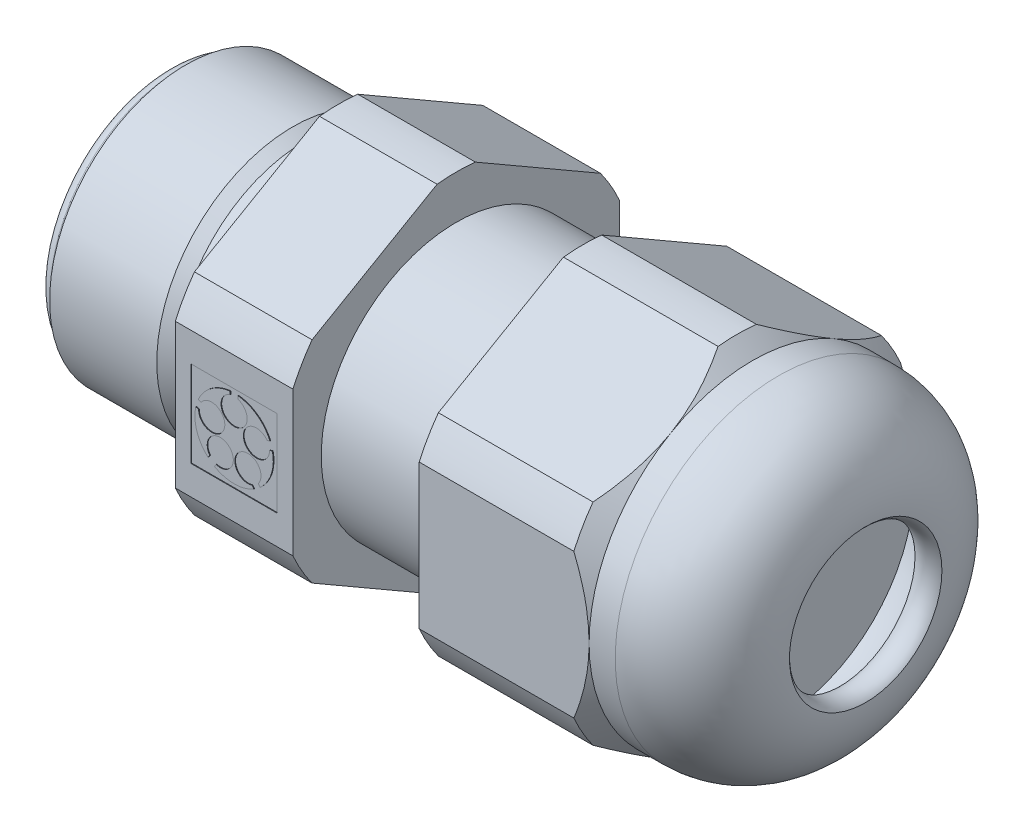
ISO-10303-21;
HEADER;
FILE_DESCRIPTION(('STEP AP214'),'2;1');
FILE_NAME('part.step','',(''),(''),'','','');
FILE_SCHEMA(('AUTOMOTIVE_DESIGN { 1 0 10303 214 1 1 1 1 }'));
ENDSEC;
DATA;
#1=APPLICATION_CONTEXT('core data for automotive mechanical design processes');
#2=APPLICATION_PROTOCOL_DEFINITION('international standard','automotive_design',2000,#1);
#3=PRODUCT_CONTEXT('',#1,'mechanical');
#4=PRODUCT('Part','Part','',(#3));
#5=PRODUCT_RELATED_PRODUCT_CATEGORY('part','',(#4));
#6=PRODUCT_DEFINITION_FORMATION('','',#4);
#7=PRODUCT_DEFINITION_CONTEXT('part definition',#1,'design');
#8=PRODUCT_DEFINITION('design','',#6,#7);
#9=PRODUCT_DEFINITION_SHAPE('','',#8);
#10=(LENGTH_UNIT() NAMED_UNIT(*) SI_UNIT(.MILLI.,.METRE.));
#11=(NAMED_UNIT(*) PLANE_ANGLE_UNIT() SI_UNIT($,.RADIAN.));
#12=(NAMED_UNIT(*) SI_UNIT($,.STERADIAN.) SOLID_ANGLE_UNIT());
#13=UNCERTAINTY_MEASURE_WITH_UNIT(LENGTH_MEASURE(1.E-05),#10,'distance_accuracy_value','');
#14=(GEOMETRIC_REPRESENTATION_CONTEXT(3) GLOBAL_UNCERTAINTY_ASSIGNED_CONTEXT((#13)) GLOBAL_UNIT_ASSIGNED_CONTEXT((#10,
#11,#12)) REPRESENTATION_CONTEXT('',''));
#15=CARTESIAN_POINT('',(0.,0.,0.));
#16=DIRECTION('',(0.,0.,1.));
#17=DIRECTION('',(1.,0.,0.));
#18=AXIS2_PLACEMENT_3D('',#15,#16,#17);
#19=CARTESIAN_POINT('',(26.8,0.,0.));
#20=DIRECTION('',(-1.,0.,0.));
#21=DIRECTION('',(0.,0.,1.));
#22=AXIS2_PLACEMENT_3D('',#19,#20,#21);
#23=CONICAL_SURFACE('',#22,7.5,0.785398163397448);
#24=CARTESIAN_POINT('',(26.0999066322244,-8.15286444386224,0.87882455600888));
#25=CARTESIAN_POINT('',(26.2004176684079,-8.02860033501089,1.09405630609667));
#26=CARTESIAN_POINT('',(26.2928735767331,-7.902546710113,1.31238758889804));
#27=CARTESIAN_POINT('',(26.4580042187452,-7.64687099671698,1.75523091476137));
#28=CARTESIAN_POINT('',(26.5306223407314,-7.51723983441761,1.97975867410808));
#29=CARTESIAN_POINT('',(26.6512408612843,-7.25632301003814,2.43167987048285));
#30=CARTESIAN_POINT('',(26.6994600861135,-7.12506327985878,2.65902839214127));
#31=CARTESIAN_POINT('',(26.7689599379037,-6.86089712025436,3.11657760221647));
#32=CARTESIAN_POINT('',(26.7902728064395,-6.72799285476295,3.34677454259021));
#33=CARTESIAN_POINT('',(26.8041085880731,-6.46777211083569,3.79749009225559));
#34=CARTESIAN_POINT('',(26.7978793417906,-6.34047223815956,4.01797993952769));
#35=CARTESIAN_POINT('',(26.7598987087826,-6.08678333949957,4.45738200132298));
#36=CARTESIAN_POINT('',(26.7281349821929,-5.96039478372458,4.67629340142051));
#37=CARTESIAN_POINT('',(26.6412536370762,-5.70980418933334,5.11032904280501));
#38=CARTESIAN_POINT('',(26.5861577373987,-5.58560022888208,5.32545661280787));
#39=CARTESIAN_POINT('',(26.4557201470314,-5.33988592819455,5.75104626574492));
#40=CARTESIAN_POINT('',(26.3803750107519,-5.21837605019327,5.96150754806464));
#41=CARTESIAN_POINT('',(26.2659458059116,-5.05446076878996,6.24541714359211));
#42=CARTESIAN_POINT('',(26.2341568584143,-5.01074375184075,6.32113723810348));
#43=CARTESIAN_POINT('',(26.1685364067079,-4.92379267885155,6.47174091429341));
#44=CARTESIAN_POINT('',(26.1347090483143,-4.88055784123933,6.54662584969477));
#45=CARTESIAN_POINT('',(26.0999066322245,-4.83751661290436,6.6211754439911));
#46=B_SPLINE_CURVE_WITH_KNOTS('',3,(#24,#25,#26,#27,#28,#29,#30,#31,#32,#33,#34,#35,#36,#37,#38,
#39,#40,#41,#42,#43,#44,#45),.UNSPECIFIED.,.F.,.F.,(4,2,2,2,2,2,2,2,2,2,4),(0.,0.80455899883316,
1.61139056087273,2.41085160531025,3.20935375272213,3.97205845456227,4.73513196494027,
5.4974967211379,6.25999128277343,6.5390744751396,6.81760805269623),.UNSPECIFIED.);
#47=CARTESIAN_POINT('',(26.0999999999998,-8.1527489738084,0.87902455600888));
#48=VERTEX_POINT('',#47);
#49=CARTESIAN_POINT('',(26.8,-6.49519052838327,3.75000000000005));
#50=VERTEX_POINT('',#49);
#51=EDGE_CURVE('E749',#48,#50,#46,.T.);
#52=ORIENTED_EDGE('',*,*,#51,.F.);
#53=CARTESIAN_POINT('',(26.0999999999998,0.,0.));
#54=DIRECTION('',(-1.,0.,0.));
#55=DIRECTION('',(0.,0.,1.));
#56=AXIS2_PLACEMENT_3D('',#53,#54,#55);
#57=CIRCLE('',#56,8.20000000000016);
#58=CARTESIAN_POINT('',(26.1,-8.15274897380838,-0.879024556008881));
#59=VERTEX_POINT('',#58);
#60=EDGE_CURVE('E737',#59,#48,#57,.T.);
#61=ORIENTED_EDGE('',*,*,#60,.F.);
#62=CARTESIAN_POINT('',(26.0999066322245,-4.83751661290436,-6.6211754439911));
#63=CARTESIAN_POINT('',(26.200417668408,-4.9617807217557,-6.40594369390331));
#64=CARTESIAN_POINT('',(26.2928735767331,-5.08783434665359,-6.18761241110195));
#65=CARTESIAN_POINT('',(26.4580042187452,-5.34351006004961,-5.74476908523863));
#66=CARTESIAN_POINT('',(26.5306223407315,-5.47314122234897,-5.52024132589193));
#67=CARTESIAN_POINT('',(26.6512408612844,-5.73405804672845,-5.06832012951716));
#68=CARTESIAN_POINT('',(26.6994600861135,-5.8653177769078,-4.84097160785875));
#69=CARTESIAN_POINT('',(26.7689599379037,-6.12948393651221,-4.38342239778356));
#70=CARTESIAN_POINT('',(26.7902728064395,-6.26238820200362,-4.15322545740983));
#71=CARTESIAN_POINT('',(26.8041085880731,-6.52260894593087,-3.70250990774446));
#72=CARTESIAN_POINT('',(26.7978793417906,-6.649908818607,-3.48202006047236));
#73=CARTESIAN_POINT('',(26.7598987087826,-6.90359771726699,-3.04261799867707));
#74=CARTESIAN_POINT('',(26.7281349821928,-7.02998627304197,-2.82370659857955));
#75=CARTESIAN_POINT('',(26.6412536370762,-7.28057686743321,-2.38967095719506));
#76=CARTESIAN_POINT('',(26.5861577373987,-7.40478082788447,-2.1745433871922));
#77=CARTESIAN_POINT('',(26.4557201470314,-7.65049512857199,-1.74895373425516));
#78=CARTESIAN_POINT('',(26.3803750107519,-7.77200500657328,-1.53849245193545));
#79=CARTESIAN_POINT('',(26.2659458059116,-7.93592028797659,-1.25458285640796));
#80=CARTESIAN_POINT('',(26.2341568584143,-7.97963730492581,-1.17886276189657));
#81=CARTESIAN_POINT('',(26.1685364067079,-8.06658837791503,-1.0282590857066));
#82=CARTESIAN_POINT('',(26.1347090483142,-8.10982321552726,-0.953374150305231));
#83=CARTESIAN_POINT('',(26.0999066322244,-8.15286444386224,-0.878824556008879));
#84=B_SPLINE_CURVE_WITH_KNOTS('',3,(#62,#63,#64,#65,#66,#67,#68,#69,#70,#71,#72,#73,#74,#75,#76,
#77,#78,#79,#80,#81,#82,#83),.UNSPECIFIED.,.F.,.F.,(4,2,2,2,2,2,2,2,2,2,4),(0.,
0.804558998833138,1.61139056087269,2.41085160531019,3.20935375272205,3.97205845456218,
4.73513196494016,5.49749672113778,6.2599912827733,6.53907447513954,6.81760805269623),.UNSPECIFIED.);
#85=CARTESIAN_POINT('',(26.8,-6.49519052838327,-3.75000000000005));
#86=VERTEX_POINT('',#85);
#87=EDGE_CURVE('E723',#86,#59,#84,.T.);
#88=ORIENTED_EDGE('',*,*,#87,.F.);
#89=CARTESIAN_POINT('',(26.8,0.,0.));
#90=DIRECTION('',(1.,0.,0.));
#91=DIRECTION('',(0.,0.,-1.));
#92=AXIS2_PLACEMENT_3D('',#89,#90,#91);
#93=CIRCLE('',#92,7.5);
#94=EDGE_CURVE('E966',#50,#86,#93,.T.);
#95=ORIENTED_EDGE('',*,*,#94,.F.);
#96=EDGE_LOOP('',(#52,#61,#88,#95));
#97=FACE_BOUND('',#96,.T.);
#98=ADVANCED_FACE('F36',(#97),#23,.T.);
#99=CARTESIAN_POINT('',(26.1,-4.8376320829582,6.6209754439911));
#100=VERTEX_POINT('',#99);
#101=EDGE_CURVE('E743',#50,#100,#46,.T.);
#102=ORIENTED_EDGE('',*,*,#101,.F.);
#103=CARTESIAN_POINT('',(26.8,0.,7.5));
#104=VERTEX_POINT('',#103);
#105=EDGE_CURVE('E960',#104,#50,#93,.T.);
#106=ORIENTED_EDGE('',*,*,#105,.F.);
#107=CARTESIAN_POINT('',(23.406952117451,-7.89990456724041,7.5));
#108=CARTESIAN_POINT('',(23.5486100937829,-7.704530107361,7.5));
#109=CARTESIAN_POINT('',(23.6886856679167,-7.50798822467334,7.5));
#110=CARTESIAN_POINT('',(23.9649952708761,-7.11214455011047,7.5));
#111=CARTESIAN_POINT('',(24.1012282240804,-6.91284200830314,7.5));
#112=CARTESIAN_POINT('',(24.370114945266,-6.50963267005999,7.5));
#113=CARTESIAN_POINT('',(24.502733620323,-6.30570238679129,7.5));
#114=CARTESIAN_POINT('',(24.7623278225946,-5.89429142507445,7.5));
#115=CARTESIAN_POINT('',(24.889303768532,-5.68681101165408,7.5));
#116=CARTESIAN_POINT('',(25.1421106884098,-5.25816182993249,7.5));
#117=CARTESIAN_POINT('',(25.2676201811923,-5.0368024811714,7.5));
#118=CARTESIAN_POINT('',(25.5094452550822,-4.58904794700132,7.5));
#119=CARTESIAN_POINT('',(25.6257595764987,-4.36265207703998,7.5));
#120=CARTESIAN_POINT('',(25.8466616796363,-3.90499293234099,7.5));
#121=CARTESIAN_POINT('',(25.9512831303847,-3.67374603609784,7.5));
#122=CARTESIAN_POINT('',(26.1464937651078,-3.20545213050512,7.5));
#123=CARTESIAN_POINT('',(26.2370886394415,-2.96840751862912,7.5));
#124=CARTESIAN_POINT('',(26.398343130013,-2.4967093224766,7.5));
#125=CARTESIAN_POINT('',(26.4695839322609,-2.26225666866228,7.5));
#126=CARTESIAN_POINT('',(26.5931327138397,-1.78832033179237,7.5));
#127=CARTESIAN_POINT('',(26.645439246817,-1.54883626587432,7.5));
#128=CARTESIAN_POINT('',(26.7276810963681,-1.06991914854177,7.5));
#129=CARTESIAN_POINT('',(26.757958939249,-0.83054584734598,7.5));
#130=CARTESIAN_POINT('',(26.7956565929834,-0.349998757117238,7.5));
#131=CARTESIAN_POINT('',(26.8030791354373,-0.10882518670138,7.5));
#132=CARTESIAN_POINT('',(26.7947003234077,0.36700547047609,7.5));
#133=CARTESIAN_POINT('',(26.7794812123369,0.601673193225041,7.5));
#134=CARTESIAN_POINT('',(26.7278066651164,1.06864390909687,7.5));
#135=CARTESIAN_POINT('',(26.6913489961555,1.30094665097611,7.5));
#136=CARTESIAN_POINT('',(26.5984383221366,1.76542377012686,7.5));
#137=CARTESIAN_POINT('',(26.5416673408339,1.99753362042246,7.5));
#138=CARTESIAN_POINT('',(26.4109451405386,2.45676050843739,7.5));
#139=CARTESIAN_POINT('',(26.3369961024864,2.68387817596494,7.5));
#140=CARTESIAN_POINT('',(26.1607222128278,3.17144269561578,7.5));
#141=CARTESIAN_POINT('',(26.0557047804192,3.43090844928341,7.5));
#142=CARTESIAN_POINT('',(25.8298328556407,3.94291363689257,7.5));
#143=CARTESIAN_POINT('',(25.7089704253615,4.19544952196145,7.5));
#144=CARTESIAN_POINT('',(25.4543154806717,4.69493848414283,7.5));
#145=CARTESIAN_POINT('',(25.3204806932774,4.94186983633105,7.5));
#146=CARTESIAN_POINT('',(25.0428699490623,5.42998534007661,7.5));
#147=CARTESIAN_POINT('',(24.899095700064,5.67117046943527,7.5));
#148=CARTESIAN_POINT('',(24.6111508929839,6.13640246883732,7.5));
#149=CARTESIAN_POINT('',(24.4673758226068,6.36069541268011,7.5));
#150=CARTESIAN_POINT('',(24.1739871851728,6.80544261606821,7.5));
#151=CARTESIAN_POINT('',(24.0243731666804,7.02589657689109,7.5));
#152=CARTESIAN_POINT('',(23.7216363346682,7.4616470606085,7.5));
#153=CARTESIAN_POINT('',(23.5685532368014,7.67697127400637,7.5));
#154=CARTESIAN_POINT('',(23.2584930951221,8.10471151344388,7.5));
#155=CARTESIAN_POINT('',(23.1015171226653,8.31712831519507,7.5));
#156=CARTESIAN_POINT('',(22.9429548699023,8.52833360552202,7.5));
#157=B_SPLINE_CURVE_WITH_KNOTS('',3,(#107,#108,#109,#110,#111,#112,#113,#114,#115,#116,#117,
#118,#119,#120,#121,#122,#123,#124,#125,#126,#127,#128,#129,#130,#131,#132,#133,#134,#135,#136,
#137,#138,#139,#140,#141,#142,#143,#144,#145,#146,#147,#148,#149,#150,#151,#152,#153,#154,#155,
#156),.UNSPECIFIED.,.F.,.F.,(4,2,2,2,2,2,2,2,2,2,2,2,2,2,2,2,2,2,2,2,2,2,2,2,4),(0.,
0.723993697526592,1.44818808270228,2.17788920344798,2.9075360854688,3.67075419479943,
4.43407668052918,5.19514128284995,5.95589631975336,6.69033576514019,7.42483130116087,
8.14764667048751,8.87037564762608,9.57483761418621,10.2793736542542,10.9954587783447,
11.7114530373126,12.5505130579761,13.3899950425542,14.2323110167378,15.0744826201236,
15.8736297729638,16.6728388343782,17.4653763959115,18.2576982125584),.UNSPECIFIED.);
#158=CARTESIAN_POINT('',(26.1000000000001,-3.3151168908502,7.5));
#159=VERTEX_POINT('',#158);
#160=EDGE_CURVE('E780',#159,#104,#157,.T.);
#161=ORIENTED_EDGE('',*,*,#160,.F.);
#162=CARTESIAN_POINT('',(26.1000000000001,0.,0.));
#163=DIRECTION('',(-1.,0.,0.));
#164=DIRECTION('',(0.,0.,1.));
#165=AXIS2_PLACEMENT_3D('',#162,#163,#164);
#166=CIRCLE('',#165,8.19999999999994);
#167=EDGE_CURVE('E971',#100,#159,#166,.T.);
#168=ORIENTED_EDGE('',*,*,#167,.F.);
#169=EDGE_LOOP('',(#102,#106,#161,#168));
#170=FACE_BOUND('',#169,.T.);
#171=ADVANCED_FACE('F855',(#170),#23,.T.);
#172=CARTESIAN_POINT('',(26.0999999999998,-4.8376320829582,-6.6209754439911));
#173=VERTEX_POINT('',#172);
#174=EDGE_CURVE('E730',#173,#86,#84,.T.);
#175=ORIENTED_EDGE('',*,*,#174,.F.);
#176=CARTESIAN_POINT('',(26.0999999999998,0.,0.));
#177=DIRECTION('',(-1.,0.,0.));
#178=DIRECTION('',(0.,0.,1.));
#179=AXIS2_PLACEMENT_3D('',#176,#177,#178);
#180=CIRCLE('',#179,8.20000000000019);
#181=CARTESIAN_POINT('',(26.1,-3.3151168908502,-7.49999999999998));
#182=VERTEX_POINT('',#181);
#183=EDGE_CURVE('E898',#182,#173,#180,.T.);
#184=ORIENTED_EDGE('',*,*,#183,.F.);
#185=CARTESIAN_POINT('',(23.406952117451,-7.89990456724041,-7.5));
#186=CARTESIAN_POINT('',(23.5486100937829,-7.70453010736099,-7.5));
#187=CARTESIAN_POINT('',(23.6886856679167,-7.50798822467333,-7.5));
#188=CARTESIAN_POINT('',(23.9649952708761,-7.11214455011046,-7.5));
#189=CARTESIAN_POINT('',(24.1012282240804,-6.91284200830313,-7.5));
#190=CARTESIAN_POINT('',(24.370114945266,-6.50963267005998,-7.5));
#191=CARTESIAN_POINT('',(24.502733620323,-6.30570238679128,-7.5));
#192=CARTESIAN_POINT('',(24.7623278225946,-5.89429142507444,-7.5));
#193=CARTESIAN_POINT('',(24.889303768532,-5.68681101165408,-7.5));
#194=CARTESIAN_POINT('',(25.1421106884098,-5.25816182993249,-7.5));
#195=CARTESIAN_POINT('',(25.2676201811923,-5.0368024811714,-7.5));
#196=CARTESIAN_POINT('',(25.5094452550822,-4.58904794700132,-7.5));
#197=CARTESIAN_POINT('',(25.6257595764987,-4.36265207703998,-7.5));
#198=CARTESIAN_POINT('',(25.8466616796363,-3.90499293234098,-7.5));
#199=CARTESIAN_POINT('',(25.9512831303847,-3.67374603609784,-7.5));
#200=CARTESIAN_POINT('',(26.1464937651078,-3.20545213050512,-7.5));
#201=CARTESIAN_POINT('',(26.2370886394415,-2.96840751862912,-7.5));
#202=CARTESIAN_POINT('',(26.398343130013,-2.4967093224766,-7.5));
#203=CARTESIAN_POINT('',(26.4695839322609,-2.26225666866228,-7.5));
#204=CARTESIAN_POINT('',(26.5931327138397,-1.78832033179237,-7.5));
#205=CARTESIAN_POINT('',(26.645439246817,-1.54883626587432,-7.5));
#206=CARTESIAN_POINT('',(26.7276810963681,-1.06991914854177,-7.5));
#207=CARTESIAN_POINT('',(26.757958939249,-0.830545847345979,-7.5));
#208=CARTESIAN_POINT('',(26.7956565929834,-0.349998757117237,-7.5));
#209=CARTESIAN_POINT('',(26.8030791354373,-0.108825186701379,-7.5));
#210=CARTESIAN_POINT('',(26.7947003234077,0.367005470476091,-7.5));
#211=CARTESIAN_POINT('',(26.7794812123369,0.601673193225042,-7.5));
#212=CARTESIAN_POINT('',(26.7278066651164,1.06864390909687,-7.5));
#213=CARTESIAN_POINT('',(26.6913489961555,1.30094665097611,-7.5));
#214=CARTESIAN_POINT('',(26.5984383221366,1.76542377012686,-7.5));
#215=CARTESIAN_POINT('',(26.5416673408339,1.99753362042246,-7.5));
#216=CARTESIAN_POINT('',(26.4109451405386,2.45676050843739,-7.5));
#217=CARTESIAN_POINT('',(26.3369961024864,2.68387817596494,-7.5));
#218=CARTESIAN_POINT('',(26.1607222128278,3.17144269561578,-7.5));
#219=CARTESIAN_POINT('',(26.0557047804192,3.43090844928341,-7.5));
#220=CARTESIAN_POINT('',(25.8298328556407,3.94291363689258,-7.5));
#221=CARTESIAN_POINT('',(25.7089704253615,4.19544952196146,-7.5));
#222=CARTESIAN_POINT('',(25.4543154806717,4.69493848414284,-7.5));
#223=CARTESIAN_POINT('',(25.3204806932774,4.94186983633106,-7.5));
#224=CARTESIAN_POINT('',(25.0428699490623,5.42998534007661,-7.5));
#225=CARTESIAN_POINT('',(24.899095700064,5.67117046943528,-7.5));
#226=CARTESIAN_POINT('',(24.6111508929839,6.13640246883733,-7.5));
#227=CARTESIAN_POINT('',(24.4673758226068,6.36069541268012,-7.5));
#228=CARTESIAN_POINT('',(24.1739871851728,6.80544261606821,-7.5));
#229=CARTESIAN_POINT('',(24.0243731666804,7.0258965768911,-7.5));
#230=CARTESIAN_POINT('',(23.7216363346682,7.46164706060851,-7.5));
#231=CARTESIAN_POINT('',(23.5685532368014,7.67697127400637,-7.5));
#232=CARTESIAN_POINT('',(23.2584930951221,8.10471151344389,-7.5));
#233=CARTESIAN_POINT('',(23.1015171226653,8.31712831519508,-7.5));
#234=CARTESIAN_POINT('',(22.9429548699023,8.52833360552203,-7.5));
#235=B_SPLINE_CURVE_WITH_KNOTS('',3,(#185,#186,#187,#188,#189,#190,#191,#192,#193,#194,#195,
#196,#197,#198,#199,#200,#201,#202,#203,#204,#205,#206,#207,#208,#209,#210,#211,#212,#213,#214,
#215,#216,#217,#218,#219,#220,#221,#222,#223,#224,#225,#226,#227,#228,#229,#230,#231,#232,#233,
#234),.UNSPECIFIED.,.F.,.F.,(4,2,2,2,2,2,2,2,2,2,2,2,2,2,2,2,2,2,2,2,2,2,2,2,4),(0.,
0.723993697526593,1.44818808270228,2.17788920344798,2.9075360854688,3.67075419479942,
4.43407668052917,5.19514128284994,5.95589631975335,6.69033576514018,7.42483130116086,
8.1476466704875,8.87037564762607,9.5748376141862,10.2793736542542,10.9954587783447,
11.7114530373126,12.5505130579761,13.3899950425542,14.2323110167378,15.0744826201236,
15.8736297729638,16.6728388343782,17.4653763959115,18.2576982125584),.UNSPECIFIED.);
#236=CARTESIAN_POINT('',(26.8,0.,-7.5));
#237=VERTEX_POINT('',#236);
#238=EDGE_CURVE('E694',#237,#182,#235,.F.);
#239=ORIENTED_EDGE('',*,*,#238,.F.);
#240=EDGE_CURVE('E814',#86,#237,#93,.T.);
#241=ORIENTED_EDGE('',*,*,#240,.F.);
#242=EDGE_LOOP('',(#175,#184,#239,#241));
#243=FACE_BOUND('',#242,.T.);
#244=ADVANCED_FACE('F860',(#243),#23,.T.);
#245=CARTESIAN_POINT('',(26.1,3.3151168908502,7.5));
#246=VERTEX_POINT('',#245);
#247=EDGE_CURVE('E773',#104,#246,#157,.T.);
#248=ORIENTED_EDGE('',*,*,#247,.F.);
#249=CARTESIAN_POINT('',(26.8,6.49519052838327,3.75000000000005));
#250=VERTEX_POINT('',#249);
#251=EDGE_CURVE('E957',#250,#104,#93,.T.);
#252=ORIENTED_EDGE('',*,*,#251,.F.);
#253=CARTESIAN_POINT('',(26.0999066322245,4.83751661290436,6.6211754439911));
#254=CARTESIAN_POINT('',(26.200417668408,4.9617807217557,6.40594369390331));
#255=CARTESIAN_POINT('',(26.2928735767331,5.08783434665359,6.18761241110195));
#256=CARTESIAN_POINT('',(26.4580042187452,5.34351006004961,5.74476908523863));
#257=CARTESIAN_POINT('',(26.5306223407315,5.47314122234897,5.52024132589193));
#258=CARTESIAN_POINT('',(26.6512408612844,5.73405804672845,5.06832012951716));
#259=CARTESIAN_POINT('',(26.6994600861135,5.8653177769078,4.84097160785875));
#260=CARTESIAN_POINT('',(26.7689599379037,6.12948393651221,4.38342239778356));
#261=CARTESIAN_POINT('',(26.7902728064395,6.26238820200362,4.15322545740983));
#262=CARTESIAN_POINT('',(26.8041085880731,6.52260894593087,3.70250990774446));
#263=CARTESIAN_POINT('',(26.7978793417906,6.649908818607,3.48202006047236));
#264=CARTESIAN_POINT('',(26.7598987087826,6.90359771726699,3.04261799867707));
#265=CARTESIAN_POINT('',(26.7281349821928,7.02998627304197,2.82370659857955));
#266=CARTESIAN_POINT('',(26.6412536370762,7.28057686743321,2.38967095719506));
#267=CARTESIAN_POINT('',(26.5861577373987,7.40478082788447,2.1745433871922));
#268=CARTESIAN_POINT('',(26.4557201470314,7.65049512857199,1.74895373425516));
#269=CARTESIAN_POINT('',(26.3803750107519,7.77200500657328,1.53849245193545));
#270=CARTESIAN_POINT('',(26.2659458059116,7.93592028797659,1.25458285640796));
#271=CARTESIAN_POINT('',(26.2341568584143,7.97963730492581,1.17886276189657));
#272=CARTESIAN_POINT('',(26.1685364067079,8.06658837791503,1.0282590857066));
#273=CARTESIAN_POINT('',(26.1347090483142,8.10982321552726,0.953374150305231));
#274=CARTESIAN_POINT('',(26.0999066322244,8.15286444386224,0.878824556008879));
#275=B_SPLINE_CURVE_WITH_KNOTS('',3,(#253,#254,#255,#256,#257,#258,#259,#260,#261,#262,#263,
#264,#265,#266,#267,#268,#269,#270,#271,#272,#273,#274),.UNSPECIFIED.,.F.,.F.,(4,2,2,2,2,2,2,2,
2,2,4),(0.,0.804558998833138,1.61139056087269,2.41085160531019,3.20935375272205,
3.97205845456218,4.73513196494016,5.49749672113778,6.2599912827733,6.53907447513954,
6.81760805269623),.UNSPECIFIED.);
#276=CARTESIAN_POINT('',(26.1,4.8376320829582,6.6209754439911));
#277=VERTEX_POINT('',#276);
#278=EDGE_CURVE('E643',#277,#250,#275,.T.);
#279=ORIENTED_EDGE('',*,*,#278,.F.);
#280=CARTESIAN_POINT('',(26.1000000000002,0.,0.));
#281=DIRECTION('',(-1.,0.,0.));
#282=DIRECTION('',(0.,0.,1.));
#283=AXIS2_PLACEMENT_3D('',#280,#281,#282);
#284=CIRCLE('',#283,8.19999999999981);
#285=EDGE_CURVE('E788',#246,#277,#284,.T.);
#286=ORIENTED_EDGE('',*,*,#285,.F.);
#287=EDGE_LOOP('',(#248,#252,#279,#286));
#288=FACE_BOUND('',#287,.T.);
#289=ADVANCED_FACE('F879',(#288),#23,.T.);
#290=CARTESIAN_POINT('',(26.0999999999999,3.3151168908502,-7.5));
#291=VERTEX_POINT('',#290);
#292=EDGE_CURVE('E700',#291,#237,#235,.F.);
#293=ORIENTED_EDGE('',*,*,#292,.F.);
#294=CARTESIAN_POINT('',(26.0999999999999,0.,0.));
#295=DIRECTION('',(-1.,0.,0.));
#296=DIRECTION('',(0.,0.,1.));
#297=AXIS2_PLACEMENT_3D('',#294,#295,#296);
#298=CIRCLE('',#297,8.20000000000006);
#299=CARTESIAN_POINT('',(26.1,4.83763208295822,-6.62097544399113));
#300=VERTEX_POINT('',#299);
#301=EDGE_CURVE('E688',#300,#291,#298,.T.);
#302=ORIENTED_EDGE('',*,*,#301,.F.);
#303=CARTESIAN_POINT('',(26.0999066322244,8.15286444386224,-0.87882455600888));
#304=CARTESIAN_POINT('',(26.2004176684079,8.02860033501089,-1.09405630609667));
#305=CARTESIAN_POINT('',(26.2928735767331,7.902546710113,-1.31238758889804));
#306=CARTESIAN_POINT('',(26.4580042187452,7.64687099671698,-1.75523091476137));
#307=CARTESIAN_POINT('',(26.5306223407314,7.51723983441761,-1.97975867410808));
#308=CARTESIAN_POINT('',(26.6512408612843,7.25632301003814,-2.43167987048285));
#309=CARTESIAN_POINT('',(26.6994600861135,7.12506327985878,-2.65902839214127));
#310=CARTESIAN_POINT('',(26.7689599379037,6.86089712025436,-3.11657760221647));
#311=CARTESIAN_POINT('',(26.7902728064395,6.72799285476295,-3.34677454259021));
#312=CARTESIAN_POINT('',(26.8041085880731,6.46777211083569,-3.79749009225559));
#313=CARTESIAN_POINT('',(26.7978793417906,6.34047223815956,-4.01797993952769));
#314=CARTESIAN_POINT('',(26.7598987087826,6.08678333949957,-4.45738200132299));
#315=CARTESIAN_POINT('',(26.7281349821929,5.96039478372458,-4.67629340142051));
#316=CARTESIAN_POINT('',(26.6412536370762,5.70980418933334,-5.11032904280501));
#317=CARTESIAN_POINT('',(26.5861577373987,5.58560022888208,-5.32545661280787));
#318=CARTESIAN_POINT('',(26.4557201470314,5.33988592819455,-5.75104626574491));
#319=CARTESIAN_POINT('',(26.3803750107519,5.21837605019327,-5.96150754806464));
#320=CARTESIAN_POINT('',(26.2659458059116,5.05446076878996,-6.24541714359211));
#321=CARTESIAN_POINT('',(26.2341568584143,5.01074375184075,-6.32113723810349));
#322=CARTESIAN_POINT('',(26.1685364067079,4.92379267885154,-6.47174091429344));
#323=CARTESIAN_POINT('',(26.1347090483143,4.88055784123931,-6.54662584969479));
#324=CARTESIAN_POINT('',(26.0999066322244,4.83751661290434,-6.62117544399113));
#325=B_SPLINE_CURVE_WITH_KNOTS('',3,(#303,#304,#305,#306,#307,#308,#309,#310,#311,#312,#313,
#314,#315,#316,#317,#318,#319,#320,#321,#322,#323,#324),.UNSPECIFIED.,.F.,.F.,(4,2,2,2,2,2,2,2,
2,2,4),(0.,0.80455899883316,1.61139056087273,2.41085160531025,3.20935375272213,3.97205845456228,
4.73513196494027,5.4974967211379,6.25999128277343,6.53907447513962,6.81760805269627),.UNSPECIFIED.);
#326=CARTESIAN_POINT('',(26.8,6.49519052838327,-3.75000000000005));
#327=VERTEX_POINT('',#326);
#328=EDGE_CURVE('E674',#327,#300,#325,.T.);
#329=ORIENTED_EDGE('',*,*,#328,.F.);
#330=EDGE_CURVE('E815',#237,#327,#93,.T.);
#331=ORIENTED_EDGE('',*,*,#330,.F.);
#332=EDGE_LOOP('',(#293,#302,#329,#331));
#333=FACE_BOUND('',#332,.T.);
#334=ADVANCED_FACE('F867',(#333),#23,.T.);
#335=CARTESIAN_POINT('',(0.499999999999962,0.,0.));
#336=DIRECTION('',(1.,0.,0.));
#337=DIRECTION('',(0.,0.,-1.));
#338=AXIS2_PLACEMENT_3D('',#335,#336,#337);
#339=TOROIDAL_SURFACE('',#338,5.43750000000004,0.499999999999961);
#340=CARTESIAN_POINT('',(0.,0.,0.));
#341=DIRECTION('',(1.,0.,0.));
#342=DIRECTION('',(0.,0.,-1.));
#343=AXIS2_PLACEMENT_3D('',#340,#341,#342);
#344=CIRCLE('',#343,5.4375);
#345=CARTESIAN_POINT('',(0.,0.,-5.4375));
#346=VERTEX_POINT('',#345);
#347=EDGE_CURVE('E11',#346,#346,#344,.T.);
#348=ORIENTED_EDGE('',*,*,#347,.T.);
#349=EDGE_LOOP('',(#348));
#350=FACE_BOUND('',#349,.T.);
#351=CARTESIAN_POINT('',(0.5,0.,0.));
#352=DIRECTION('',(1.,0.,0.));
#353=DIRECTION('',(0.,0.,-1.));
#354=AXIS2_PLACEMENT_3D('',#351,#352,#353);
#355=CIRCLE('',#354,5.9375);
#356=CARTESIAN_POINT('',(0.5,0.,-5.9375));
#357=VERTEX_POINT('',#356);
#358=EDGE_CURVE('E790',#357,#357,#355,.T.);
#359=ORIENTED_EDGE('',*,*,#358,.F.);
#360=EDGE_LOOP('',(#359));
#361=FACE_BOUND('',#360,.T.);
#362=ADVANCED_FACE('F38',(#350,#361),#339,.T.);
#363=CARTESIAN_POINT('',(0.,5.4375,0.));
#364=DIRECTION('',(-1.,0.,0.));
#365=DIRECTION('',(0.,0.,1.));
#366=AXIS2_PLACEMENT_3D('',#363,#364,#365);
#367=PLANE('',#366);
#368=CARTESIAN_POINT('',(0.,0.,0.));
#369=DIRECTION('',(1.,0.,0.));
#370=DIRECTION('',(0.,0.,-1.));
#371=AXIS2_PLACEMENT_3D('',#368,#369,#370);
#372=CIRCLE('',#371,1.75);
#373=CARTESIAN_POINT('',(0.,0.,-1.75));
#374=VERTEX_POINT('',#373);
#375=EDGE_CURVE('E44',#374,#374,#372,.T.);
#376=ORIENTED_EDGE('',*,*,#375,.T.);
#377=EDGE_LOOP('',(#376));
#378=FACE_BOUND('',#377,.T.);
#379=ORIENTED_EDGE('',*,*,#347,.F.);
#380=EDGE_LOOP('',(#379));
#381=FACE_BOUND('',#380,.T.);
#382=ADVANCED_FACE('F839',(#378,#381),#367,.T.);
#383=CARTESIAN_POINT('',(0.499999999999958,0.,0.));
#384=DIRECTION('',(1.,0.,0.));
#385=DIRECTION('',(0.,0.,-1.));
#386=AXIS2_PLACEMENT_3D('',#383,#384,#385);
#387=TOROIDAL_SURFACE('',#386,1.74999999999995,0.499999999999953);
#388=CARTESIAN_POINT('',(0.500000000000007,0.,0.));
#389=DIRECTION('',(1.,0.,0.));
#390=DIRECTION('',(0.,0.,-1.));
#391=AXIS2_PLACEMENT_3D('',#388,#389,#390);
#392=CIRCLE('',#391,1.25);
#393=CARTESIAN_POINT('',(0.500000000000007,0.,-1.25));
#394=VERTEX_POINT('',#393);
#395=EDGE_CURVE('E834',#394,#394,#392,.T.);
#396=ORIENTED_EDGE('',*,*,#395,.T.);
#397=EDGE_LOOP('',(#396));
#398=FACE_BOUND('',#397,.T.);
#399=ORIENTED_EDGE('',*,*,#375,.F.);
#400=EDGE_LOOP('',(#399));
#401=FACE_BOUND('',#400,.T.);
#402=ADVANCED_FACE('F842',(#398,#401),#387,.T.);
#403=CARTESIAN_POINT('',(32.,0.,0.));
#404=DIRECTION('',(1.,0.,0.));
#405=DIRECTION('',(0.,0.,-1.));
#406=AXIS2_PLACEMENT_3D('',#403,#404,#405);
#407=CYLINDRICAL_SURFACE('',#406,1.25);
#408=CARTESIAN_POINT('',(28.,0.,0.));
#409=DIRECTION('',(1.,0.,0.));
#410=DIRECTION('',(0.,0.,-1.));
#411=AXIS2_PLACEMENT_3D('',#408,#409,#410);
#412=CIRCLE('',#411,1.25);
#413=CARTESIAN_POINT('',(28.,0.,-1.25));
#414=VERTEX_POINT('',#413);
#415=EDGE_CURVE('E831',#414,#414,#412,.T.);
#416=ORIENTED_EDGE('',*,*,#415,.T.);
#417=EDGE_LOOP('',(#416));
#418=FACE_BOUND('',#417,.T.);
#419=ORIENTED_EDGE('',*,*,#395,.F.);
#420=EDGE_LOOP('',(#419));
#421=FACE_BOUND('',#420,.T.);
#422=ADVANCED_FACE('F844',(#418,#421),#407,.F.);
#423=CARTESIAN_POINT('',(28.,1.25,0.));
#424=DIRECTION('',(1.,0.,0.));
#425=DIRECTION('',(0.,0.,-1.));
#426=AXIS2_PLACEMENT_3D('',#423,#424,#425);
#427=PLANE('',#426);
#428=CARTESIAN_POINT('',(28.,0.,0.));
#429=DIRECTION('',(1.,0.,0.));
#430=DIRECTION('',(0.,0.,-1.));
#431=AXIS2_PLACEMENT_3D('',#428,#429,#430);
#432=CIRCLE('',#431,6.2);
#433=CARTESIAN_POINT('',(28.,0.,-6.2));
#434=VERTEX_POINT('',#433);
#435=EDGE_CURVE('E828',#434,#434,#432,.T.);
#436=ORIENTED_EDGE('',*,*,#435,.T.);
#437=EDGE_LOOP('',(#436));
#438=FACE_BOUND('',#437,.T.);
#439=ORIENTED_EDGE('',*,*,#415,.F.);
#440=EDGE_LOOP('',(#439));
#441=FACE_BOUND('',#440,.T.);
#442=ADVANCED_FACE('F851',(#438,#441),#427,.T.);
#443=CARTESIAN_POINT('',(28.0000000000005,0.,0.));
#444=DIRECTION('',(1.,0.,0.));
#445=DIRECTION('',(0.,0.,-1.));
#446=AXIS2_PLACEMENT_3D('',#443,#444,#445);
#447=TOROIDAL_SURFACE('',#446,3.50000000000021,2.69999999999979);
#448=CARTESIAN_POINT('',(30.698075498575,0.,0.));
#449=DIRECTION('',(1.,0.,0.));
#450=DIRECTION('',(0.,0.,-1.));
#451=AXIS2_PLACEMENT_3D('',#448,#449,#450);
#452=CIRCLE('',#451,3.6019245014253);
#453=CARTESIAN_POINT('',(30.698075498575,0.,-3.6019245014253));
#454=VERTEX_POINT('',#453);
#455=EDGE_CURVE('E825',#454,#454,#452,.T.);
#456=ORIENTED_EDGE('',*,*,#455,.T.);
#457=EDGE_LOOP('',(#456));
#458=FACE_BOUND('',#457,.T.);
#459=ORIENTED_EDGE('',*,*,#435,.F.);
#460=EDGE_LOOP('',(#459));
#461=FACE_BOUND('',#460,.T.);
#462=ADVANCED_FACE('F1558',(#458,#461),#447,.F.);
#463=CARTESIAN_POINT('',(31.3851137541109,0.,0.));
#464=DIRECTION('',(1.,0.,0.));
#465=DIRECTION('',(0.,0.,-1.));
#466=AXIS2_PLACEMENT_3D('',#463,#464,#465);
#467=TOROIDAL_SURFACE('',#466,4.0117762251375,0.799999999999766);
#468=CARTESIAN_POINT('',(32.,0.,0.));
#469=DIRECTION('',(1.,0.,0.));
#470=DIRECTION('',(0.,0.,-1.));
#471=AXIS2_PLACEMENT_3D('',#468,#469,#470);
#472=CIRCLE('',#471,3.5);
#473=CARTESIAN_POINT('',(32.,0.,-3.5));
#474=VERTEX_POINT('',#473);
#475=EDGE_CURVE('E822',#474,#474,#472,.T.);
#476=ORIENTED_EDGE('',*,*,#475,.T.);
#477=EDGE_LOOP('',(#476));
#478=FACE_BOUND('',#477,.T.);
#479=ORIENTED_EDGE('',*,*,#455,.F.);
#480=EDGE_LOOP('',(#479));
#481=FACE_BOUND('',#480,.T.);
#482=ADVANCED_FACE('F1548',(#478,#481),#467,.T.);
#483=CARTESIAN_POINT('',(28.0000000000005,0.,0.));
#484=DIRECTION('',(1.,0.,0.));
#485=DIRECTION('',(0.,0.,-1.));
#486=AXIS2_PLACEMENT_3D('',#483,#484,#485);
#487=DEGENERATE_TOROIDAL_SURFACE('',#486,3.50000000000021,3.99999999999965,.T.);
#488=CARTESIAN_POINT('',(28.,0.,0.));
#489=DIRECTION('',(1.,0.,0.));
#490=DIRECTION('',(0.,0.,-1.));
#491=AXIS2_PLACEMENT_3D('',#488,#489,#490);
#492=CIRCLE('',#491,7.49999999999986);
#493=CARTESIAN_POINT('',(28.,0.,-7.49999999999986));
#494=VERTEX_POINT('',#493);
#495=EDGE_CURVE('E818',#494,#494,#492,.T.);
#496=ORIENTED_EDGE('',*,*,#495,.T.);
#497=EDGE_LOOP('',(#496));
#498=FACE_BOUND('',#497,.T.);
#499=ORIENTED_EDGE('',*,*,#475,.F.);
#500=EDGE_LOOP('',(#499));
#501=FACE_BOUND('',#500,.T.);
#502=ADVANCED_FACE('F875',(#498,#501),#487,.T.);
#503=CARTESIAN_POINT('',(32.,0.,0.));
#504=DIRECTION('',(1.,0.,0.));
#505=DIRECTION('',(0.,0.,-1.));
#506=AXIS2_PLACEMENT_3D('',#503,#504,#505);
#507=CYLINDRICAL_SURFACE('',#506,7.49999999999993);
#508=ORIENTED_EDGE('',*,*,#251,.T.);
#509=ORIENTED_EDGE('',*,*,#105,.T.);
#510=ORIENTED_EDGE('',*,*,#94,.T.);
#511=ORIENTED_EDGE('',*,*,#240,.T.);
#512=ORIENTED_EDGE('',*,*,#330,.T.);
#513=EDGE_CURVE('E819',#327,#250,#93,.T.);
#514=ORIENTED_EDGE('',*,*,#513,.T.);
#515=EDGE_LOOP('',(#508,#509,#510,#511,#512,#514));
#516=FACE_BOUND('',#515,.T.);
#517=ORIENTED_EDGE('',*,*,#495,.F.);
#518=EDGE_LOOP('',(#517));
#519=FACE_BOUND('',#518,.T.);
#520=ADVANCED_FACE('F865',(#516,#519),#507,.T.);
#521=CARTESIAN_POINT('',(26.1000000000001,8.1527489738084,-0.87902455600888));
#522=VERTEX_POINT('',#521);
#523=EDGE_CURVE('E681',#522,#327,#325,.T.);
#524=ORIENTED_EDGE('',*,*,#523,.F.);
#525=CARTESIAN_POINT('',(26.1000000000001,0.,0.));
#526=DIRECTION('',(-1.,0.,0.));
#527=DIRECTION('',(0.,0.,1.));
#528=AXIS2_PLACEMENT_3D('',#525,#526,#527);
#529=CIRCLE('',#528,8.1999999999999);
#530=CARTESIAN_POINT('',(26.1,8.15274897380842,0.879024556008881));
#531=VERTEX_POINT('',#530);
#532=EDGE_CURVE('E936',#531,#522,#529,.T.);
#533=ORIENTED_EDGE('',*,*,#532,.F.);
#534=EDGE_CURVE('E635',#250,#531,#275,.T.);
#535=ORIENTED_EDGE('',*,*,#534,.F.);
#536=ORIENTED_EDGE('',*,*,#513,.F.);
#537=EDGE_LOOP('',(#524,#533,#535,#536));
#538=FACE_BOUND('',#537,.T.);
#539=ADVANCED_FACE('F646',(#538),#23,.T.);
#540=CARTESIAN_POINT('',(7.8,10.,0.));
#541=DIRECTION('',(-1.,0.,0.));
#542=DIRECTION('',(0.,0.,1.));
#543=AXIS2_PLACEMENT_3D('',#540,#541,#542);
#544=PLANE('',#543);
#545=CARTESIAN_POINT('',(7.8,1.30104260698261E-13,1.47451495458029E-13));
#546=DIRECTION('',(1.,0.,0.));
#547=DIRECTION('',(0.,0.,-1.));
#548=AXIS2_PLACEMENT_3D('',#545,#546,#547);
#549=CIRCLE('',#548,8.19999999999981);
#550=CARTESIAN_POINT('',(7.8,4.8376320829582,6.6209754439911));
#551=VERTEX_POINT('',#550);
#552=CARTESIAN_POINT('',(7.8,3.3151168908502,7.5));
#553=VERTEX_POINT('',#552);
#554=EDGE_CURVE('E554',#551,#553,#549,.T.);
#555=ORIENTED_EDGE('',*,*,#554,.F.);
#556=DIRECTION('',(0.,-0.500000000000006,0.866025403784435));
#557=VECTOR('',#556,1.);
#558=CARTESIAN_POINT('',(7.8,8.1527489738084,0.87902455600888));
#559=LINE('',#558,#557);
#560=CARTESIAN_POINT('',(7.8,8.1527489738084,0.879024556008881));
#561=VERTEX_POINT('',#560);
#562=EDGE_CURVE('E591',#561,#551,#559,.T.);
#563=ORIENTED_EDGE('',*,*,#562,.F.);
#564=CARTESIAN_POINT('',(7.8,1.30104260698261E-13,1.47451495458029E-13));
#565=DIRECTION('',(1.,0.,0.));
#566=DIRECTION('',(0.,0.,-1.));
#567=AXIS2_PLACEMENT_3D('',#564,#565,#566);
#568=CIRCLE('',#567,8.1999999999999);
#569=CARTESIAN_POINT('',(7.8,8.1527489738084,-0.87902455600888));
#570=VERTEX_POINT('',#569);
#571=EDGE_CURVE('E589',#570,#561,#568,.T.);
#572=ORIENTED_EDGE('',*,*,#571,.F.);
#573=DIRECTION('',(0.,0.500000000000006,0.866025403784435));
#574=VECTOR('',#573,1.);
#575=CARTESIAN_POINT('',(7.8,4.8376320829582,-6.6209754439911));
#576=LINE('',#575,#574);
#577=CARTESIAN_POINT('',(7.8,4.83763208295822,-6.62097544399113));
#578=VERTEX_POINT('',#577);
#579=EDGE_CURVE('E586',#578,#570,#576,.T.);
#580=ORIENTED_EDGE('',*,*,#579,.F.);
#581=CARTESIAN_POINT('',(7.8,1.30104260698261E-13,1.47451495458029E-13));
#582=DIRECTION('',(1.,0.,0.));
#583=DIRECTION('',(0.,0.,-1.));
#584=AXIS2_PLACEMENT_3D('',#581,#582,#583);
#585=CIRCLE('',#584,8.20000000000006);
#586=CARTESIAN_POINT('',(7.8,3.3151168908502,-7.5));
#587=VERTEX_POINT('',#586);
#588=EDGE_CURVE('E583',#587,#578,#585,.T.);
#589=ORIENTED_EDGE('',*,*,#588,.F.);
#590=DIRECTION('',(0.,1.,0.));
#591=VECTOR('',#590,1.);
#592=CARTESIAN_POINT('',(7.8,-3.3151168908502,-7.5));
#593=LINE('',#592,#591);
#594=CARTESIAN_POINT('',(7.8,-3.3151168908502,-7.49999999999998));
#595=VERTEX_POINT('',#594);
#596=EDGE_CURVE('E580',#595,#587,#593,.T.);
#597=ORIENTED_EDGE('',*,*,#596,.F.);
#598=CARTESIAN_POINT('',(7.8,1.30104260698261E-13,1.47451495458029E-13));
#599=DIRECTION('',(1.,0.,0.));
#600=DIRECTION('',(0.,0.,-1.));
#601=AXIS2_PLACEMENT_3D('',#598,#599,#600);
#602=CIRCLE('',#601,8.20000000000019);
#603=CARTESIAN_POINT('',(7.8,-4.8376320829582,-6.6209754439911));
#604=VERTEX_POINT('',#603);
#605=EDGE_CURVE('E577',#604,#595,#602,.T.);
#606=ORIENTED_EDGE('',*,*,#605,.F.);
#607=DIRECTION('',(0.,0.500000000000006,-0.866025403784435));
#608=VECTOR('',#607,1.);
#609=CARTESIAN_POINT('',(7.8,-8.1527489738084,-0.87902455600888));
#610=LINE('',#609,#608);
#611=CARTESIAN_POINT('',(7.8,-8.15274897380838,-0.879024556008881));
#612=VERTEX_POINT('',#611);
#613=EDGE_CURVE('E574',#612,#604,#610,.T.);
#614=ORIENTED_EDGE('',*,*,#613,.F.);
#615=CARTESIAN_POINT('',(7.8,1.30104260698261E-13,1.47451495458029E-13));
#616=DIRECTION('',(1.,0.,0.));
#617=DIRECTION('',(0.,0.,-1.));
#618=AXIS2_PLACEMENT_3D('',#615,#616,#617);
#619=CIRCLE('',#618,8.20000000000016);
#620=CARTESIAN_POINT('',(7.8,-8.1527489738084,0.87902455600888));
#621=VERTEX_POINT('',#620);
#622=EDGE_CURVE('E571',#621,#612,#619,.T.);
#623=ORIENTED_EDGE('',*,*,#622,.F.);
#624=DIRECTION('',(0.,-0.500000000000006,-0.866025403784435));
#625=VECTOR('',#624,1.);
#626=CARTESIAN_POINT('',(7.8,-4.8376320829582,6.6209754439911));
#627=LINE('',#626,#625);
#628=CARTESIAN_POINT('',(7.8,-4.8376320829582,6.6209754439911));
#629=VERTEX_POINT('',#628);
#630=EDGE_CURVE('E568',#629,#621,#627,.T.);
#631=ORIENTED_EDGE('',*,*,#630,.F.);
#632=CARTESIAN_POINT('',(7.8,1.30104260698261E-13,1.47451495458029E-13));
#633=DIRECTION('',(1.,0.,0.));
#634=DIRECTION('',(0.,0.,-1.));
#635=AXIS2_PLACEMENT_3D('',#632,#633,#634);
#636=CIRCLE('',#635,8.19999999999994);
#637=CARTESIAN_POINT('',(7.8,-3.3151168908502,7.5));
#638=VERTEX_POINT('',#637);
#639=EDGE_CURVE('E565',#638,#629,#636,.T.);
#640=ORIENTED_EDGE('',*,*,#639,.F.);
#641=DIRECTION('',(0.,-1.,0.));
#642=VECTOR('',#641,1.);
#643=CARTESIAN_POINT('',(7.8,3.3151168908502,7.5));
#644=LINE('',#643,#642);
#645=EDGE_CURVE('E562',#553,#638,#644,.T.);
#646=ORIENTED_EDGE('',*,*,#645,.F.);
#647=EDGE_LOOP('',(#555,#563,#572,#580,#589,#597,#606,#614,#623,#631,#640,#646));
#648=FACE_BOUND('',#647,.T.);
#649=CARTESIAN_POINT('',(7.8,0.,0.));
#650=DIRECTION('',(1.,0.,0.));
#651=DIRECTION('',(0.,0.,-1.));
#652=AXIS2_PLACEMENT_3D('',#649,#650,#651);
#653=CIRCLE('',#652,5.9375);
#654=CARTESIAN_POINT('',(7.8,0.,-5.9375));
#655=VERTEX_POINT('',#654);
#656=EDGE_CURVE('E805',#655,#655,#653,.T.);
#657=ORIENTED_EDGE('',*,*,#656,.T.);
#658=EDGE_LOOP('',(#657));
#659=FACE_BOUND('',#658,.T.);
#660=ADVANCED_FACE('F864',(#648,#659),#544,.T.);
#661=CARTESIAN_POINT('',(32.,0.,0.));
#662=DIRECTION('',(1.,0.,0.));
#663=DIRECTION('',(0.,0.,-1.));
#664=AXIS2_PLACEMENT_3D('',#661,#662,#663);
#665=CYLINDRICAL_SURFACE('',#664,5.9375);
#666=CARTESIAN_POINT('',(6.24,0.,0.));
#667=DIRECTION('',(1.,0.,0.));
#668=DIRECTION('',(0.,0.,-1.));
#669=AXIS2_PLACEMENT_3D('',#666,#667,#668);
#670=CIRCLE('',#669,5.9375);
#671=CARTESIAN_POINT('',(6.24,0.,-5.9375));
#672=VERTEX_POINT('',#671);
#673=EDGE_CURVE('E802',#672,#672,#670,.T.);
#674=ORIENTED_EDGE('',*,*,#673,.T.);
#675=EDGE_LOOP('',(#674));
#676=FACE_BOUND('',#675,.T.);
#677=ORIENTED_EDGE('',*,*,#656,.F.);
#678=EDGE_LOOP('',(#677));
#679=FACE_BOUND('',#678,.T.);
#680=ADVANCED_FACE('F872',(#676,#679),#665,.T.);
#681=CARTESIAN_POINT('',(6.24,0.,0.));
#682=DIRECTION('',(-1.,0.,0.));
#683=DIRECTION('',(0.,0.,1.));
#684=AXIS2_PLACEMENT_3D('',#681,#682,#683);
#685=CONICAL_SURFACE('',#684,5.9375,0.523598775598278);
#686=CARTESIAN_POINT('',(5.6987341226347,0.,0.));
#687=DIRECTION('',(1.,0.,0.));
#688=DIRECTION('',(0.,0.,-1.));
#689=AXIS2_PLACEMENT_3D('',#686,#687,#688);
#690=CIRCLE('',#689,6.25);
#691=CARTESIAN_POINT('',(5.6987341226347,0.,-6.25));
#692=VERTEX_POINT('',#691);
#693=EDGE_CURVE('E799',#692,#692,#690,.T.);
#694=ORIENTED_EDGE('',*,*,#693,.T.);
#695=EDGE_LOOP('',(#694));
#696=FACE_BOUND('',#695,.T.);
#697=ORIENTED_EDGE('',*,*,#673,.F.);
#698=EDGE_LOOP('',(#697));
#699=FACE_BOUND('',#698,.T.);
#700=ADVANCED_FACE('F1421',(#696,#699),#685,.T.);
#701=CARTESIAN_POINT('',(32.,0.,0.));
#702=DIRECTION('',(1.,0.,0.));
#703=DIRECTION('',(0.,0.,-1.));
#704=AXIS2_PLACEMENT_3D('',#701,#702,#703);
#705=CYLINDRICAL_SURFACE('',#704,6.25);
#706=CARTESIAN_POINT('',(0.779999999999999,0.,0.));
#707=DIRECTION('',(1.,0.,0.));
#708=DIRECTION('',(0.,0.,-1.));
#709=AXIS2_PLACEMENT_3D('',#706,#707,#708);
#710=CIRCLE('',#709,6.25);
#711=CARTESIAN_POINT('',(0.779999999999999,0.,-6.25));
#712=VERTEX_POINT('',#711);
#713=EDGE_CURVE('E796',#712,#712,#710,.T.);
#714=ORIENTED_EDGE('',*,*,#713,.T.);
#715=EDGE_LOOP('',(#714));
#716=FACE_BOUND('',#715,.T.);
#717=ORIENTED_EDGE('',*,*,#693,.F.);
#718=EDGE_LOOP('',(#717));
#719=FACE_BOUND('',#718,.T.);
#720=ADVANCED_FACE('F1416',(#716,#719),#705,.T.);
#721=CARTESIAN_POINT('',(0.78,6.25,0.));
#722=DIRECTION('',(-1.,0.,0.));
#723=DIRECTION('',(0.,0.,1.));
#724=AXIS2_PLACEMENT_3D('',#721,#722,#723);
#725=PLANE('',#724);
#726=CARTESIAN_POINT('',(0.779999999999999,0.,0.));
#727=DIRECTION('',(1.,0.,0.));
#728=DIRECTION('',(0.,0.,-1.));
#729=AXIS2_PLACEMENT_3D('',#726,#727,#728);
#730=CIRCLE('',#729,5.9375);
#731=CARTESIAN_POINT('',(0.779999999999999,0.,-5.9375));
#732=VERTEX_POINT('',#731);
#733=EDGE_CURVE('E793',#732,#732,#730,.T.);
#734=ORIENTED_EDGE('',*,*,#733,.T.);
#735=EDGE_LOOP('',(#734));
#736=FACE_BOUND('',#735,.T.);
#737=ORIENTED_EDGE('',*,*,#713,.F.);
#738=EDGE_LOOP('',(#737));
#739=FACE_BOUND('',#738,.T.);
#740=ADVANCED_FACE('F1420',(#736,#739),#725,.T.);
#741=CARTESIAN_POINT('',(32.,0.,0.));
#742=DIRECTION('',(1.,0.,0.));
#743=DIRECTION('',(0.,0.,-1.));
#744=AXIS2_PLACEMENT_3D('',#741,#742,#743);
#745=CYLINDRICAL_SURFACE('',#744,5.9375);
#746=ORIENTED_EDGE('',*,*,#358,.T.);
#747=EDGE_LOOP('',(#746));
#748=FACE_BOUND('',#747,.T.);
#749=ORIENTED_EDGE('',*,*,#733,.F.);
#750=EDGE_LOOP('',(#749));
#751=FACE_BOUND('',#750,.T.);
#752=ADVANCED_FACE('F656',(#748,#751),#745,.T.);
#753=CARTESIAN_POINT('',(39.8,8.1527489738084,0.87902455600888));
#754=DIRECTION('',(0.,-0.866025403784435,-0.500000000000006));
#755=DIRECTION('',(0.,0.500000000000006,-0.866025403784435));
#756=AXIS2_PLACEMENT_3D('',#753,#754,#755);
#757=PLANE('',#756);
#758=DIRECTION('',(0.,0.500000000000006,-0.866025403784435));
#759=VECTOR('',#758,1.);
#760=CARTESIAN_POINT('',(13.2,8.0451905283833,1.06532124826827));
#761=LINE('',#760,#759);
#762=CARTESIAN_POINT('',(13.2,4.8376320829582,6.6209754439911));
#763=VERTEX_POINT('',#762);
#764=CARTESIAN_POINT('',(13.2,8.15274897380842,0.879024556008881));
#765=VERTEX_POINT('',#764);
#766=EDGE_CURVE('E631',#763,#765,#761,.T.);
#767=ORIENTED_EDGE('',*,*,#766,.T.);
#768=DIRECTION('',(-1.,0.,0.));
#769=VECTOR('',#768,1.);
#770=CARTESIAN_POINT('',(39.8,8.15274897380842,0.879024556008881));
#771=LINE('',#770,#769);
#772=EDGE_CURVE('E597',#765,#561,#771,.T.);
#773=ORIENTED_EDGE('',*,*,#772,.T.);
#774=ORIENTED_EDGE('',*,*,#562,.T.);
#775=DIRECTION('',(-1.,0.,0.));
#776=VECTOR('',#775,1.);
#777=CARTESIAN_POINT('',(39.8,4.8376320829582,6.6209754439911));
#778=LINE('',#777,#776);
#779=EDGE_CURVE('E594',#763,#551,#778,.T.);
#780=ORIENTED_EDGE('',*,*,#779,.F.);
#781=EDGE_LOOP('',(#767,#773,#774,#780));
#782=FACE_BOUND('',#781,.T.);
#783=ADVANCED_FACE('F650',(#782),#757,.F.);
#784=CARTESIAN_POINT('',(39.8,1.30104260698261E-13,1.47451495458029E-13));
#785=DIRECTION('',(-1.,0.,0.));
#786=DIRECTION('',(0.,0.,1.));
#787=AXIS2_PLACEMENT_3D('',#784,#785,#786);
#788=CYLINDRICAL_SURFACE('',#787,8.1999999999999);
#789=CARTESIAN_POINT('',(13.2,1.30104260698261E-13,1.47451495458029E-13));
#790=DIRECTION('',(1.,0.,0.));
#791=DIRECTION('',(0.,0.,-1.));
#792=AXIS2_PLACEMENT_3D('',#789,#790,#791);
#793=CIRCLE('',#792,8.1999999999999);
#794=CARTESIAN_POINT('',(13.2,8.1527489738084,-0.87902455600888));
#795=VERTEX_POINT('',#794);
#796=EDGE_CURVE('E644',#765,#795,#793,.F.);
#797=ORIENTED_EDGE('',*,*,#796,.T.);
#798=DIRECTION('',(-1.,0.,0.));
#799=VECTOR('',#798,1.);
#800=CARTESIAN_POINT('',(39.8,8.1527489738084,-0.87902455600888));
#801=LINE('',#800,#799);
#802=EDGE_CURVE('E601',#795,#570,#801,.T.);
#803=ORIENTED_EDGE('',*,*,#802,.T.);
#804=ORIENTED_EDGE('',*,*,#571,.T.);
#805=ORIENTED_EDGE('',*,*,#772,.F.);
#806=EDGE_LOOP('',(#797,#803,#804,#805));
#807=FACE_BOUND('',#806,.T.);
#808=ADVANCED_FACE('F655',(#807),#788,.T.);
#809=CARTESIAN_POINT('',(39.8,4.8376320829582,-6.6209754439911));
#810=DIRECTION('',(0.,-0.866025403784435,0.500000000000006));
#811=DIRECTION('',(0.,-0.500000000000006,-0.866025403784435));
#812=AXIS2_PLACEMENT_3D('',#809,#810,#811);
#813=PLANE('',#812);
#814=DIRECTION('',(0.,-0.500000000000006,-0.866025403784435));
#815=VECTOR('',#814,1.);
#816=CARTESIAN_POINT('',(13.2,8.0451905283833,-1.06532124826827));
#817=LINE('',#816,#815);
#818=CARTESIAN_POINT('',(13.2,4.83763208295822,-6.62097544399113));
#819=VERTEX_POINT('',#818);
#820=EDGE_CURVE('E935',#795,#819,#817,.T.);
#821=ORIENTED_EDGE('',*,*,#820,.T.);
#822=DIRECTION('',(-1.,0.,0.));
#823=VECTOR('',#822,1.);
#824=CARTESIAN_POINT('',(39.8,4.83763208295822,-6.62097544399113));
#825=LINE('',#824,#823);
#826=EDGE_CURVE('E604',#819,#578,#825,.T.);
#827=ORIENTED_EDGE('',*,*,#826,.T.);
#828=ORIENTED_EDGE('',*,*,#579,.T.);
#829=ORIENTED_EDGE('',*,*,#802,.F.);
#830=EDGE_LOOP('',(#821,#827,#828,#829));
#831=FACE_BOUND('',#830,.T.);
#832=ADVANCED_FACE('F663',(#831),#813,.F.);
#833=CARTESIAN_POINT('',(39.8,1.30104260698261E-13,1.47451495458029E-13));
#834=DIRECTION('',(-1.,0.,0.));
#835=DIRECTION('',(0.,0.,1.));
#836=AXIS2_PLACEMENT_3D('',#833,#834,#835);
#837=CYLINDRICAL_SURFACE('',#836,8.20000000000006);
#838=CARTESIAN_POINT('',(13.2,1.30104260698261E-13,1.47451495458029E-13));
#839=DIRECTION('',(1.,0.,0.));
#840=DIRECTION('',(0.,0.,-1.));
#841=AXIS2_PLACEMENT_3D('',#838,#839,#840);
#842=CIRCLE('',#841,8.20000000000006);
#843=CARTESIAN_POINT('',(13.2,3.3151168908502,-7.5));
#844=VERTEX_POINT('',#843);
#845=EDGE_CURVE('E684',#819,#844,#842,.F.);
#846=ORIENTED_EDGE('',*,*,#845,.T.);
#847=DIRECTION('',(-1.,0.,0.));
#848=VECTOR('',#847,1.);
#849=CARTESIAN_POINT('',(39.8,3.3151168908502,-7.5));
#850=LINE('',#849,#848);
#851=EDGE_CURVE('E607',#844,#587,#850,.T.);
#852=ORIENTED_EDGE('',*,*,#851,.T.);
#853=ORIENTED_EDGE('',*,*,#588,.T.);
#854=ORIENTED_EDGE('',*,*,#826,.F.);
#855=EDGE_LOOP('',(#846,#852,#853,#854));
#856=FACE_BOUND('',#855,.T.);
#857=ADVANCED_FACE('F669',(#856),#837,.T.);
#858=CARTESIAN_POINT('',(39.8,-3.3151168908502,-7.5));
#859=DIRECTION('',(0.,0.,1.));
#860=DIRECTION('',(1.,0.,0.));
#861=AXIS2_PLACEMENT_3D('',#858,#859,#860);
#862=PLANE('',#861);
#863=DIRECTION('',(0.,-1.,0.));
#864=VECTOR('',#863,1.);
#865=CARTESIAN_POINT('',(13.2,6.2,-7.5));
#866=LINE('',#865,#864);
#867=CARTESIAN_POINT('',(13.2,-3.3151168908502,-7.49999999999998));
#868=VERTEX_POINT('',#867);
#869=EDGE_CURVE('E690',#844,#868,#866,.T.);
#870=ORIENTED_EDGE('',*,*,#869,.T.);
#871=DIRECTION('',(-1.,0.,0.));
#872=VECTOR('',#871,1.);
#873=CARTESIAN_POINT('',(39.8,-3.3151168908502,-7.49999999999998));
#874=LINE('',#873,#872);
#875=EDGE_CURVE('E610',#868,#595,#874,.T.);
#876=ORIENTED_EDGE('',*,*,#875,.T.);
#877=ORIENTED_EDGE('',*,*,#596,.T.);
#878=ORIENTED_EDGE('',*,*,#851,.F.);
#879=EDGE_LOOP('',(#870,#876,#877,#878));
#880=FACE_BOUND('',#879,.T.);
#881=ADVANCED_FACE('F703',(#880),#862,.F.);
#882=CARTESIAN_POINT('',(39.8,1.30104260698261E-13,1.47451495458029E-13));
#883=DIRECTION('',(-1.,0.,0.));
#884=DIRECTION('',(0.,0.,1.));
#885=AXIS2_PLACEMENT_3D('',#882,#883,#884);
#886=CYLINDRICAL_SURFACE('',#885,8.20000000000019);
#887=CARTESIAN_POINT('',(13.2,1.30104260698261E-13,1.47451495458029E-13));
#888=DIRECTION('',(1.,0.,0.));
#889=DIRECTION('',(0.,0.,-1.));
#890=AXIS2_PLACEMENT_3D('',#887,#888,#889);
#891=CIRCLE('',#890,8.20000000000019);
#892=CARTESIAN_POINT('',(13.2,-4.8376320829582,-6.6209754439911));
#893=VERTEX_POINT('',#892);
#894=EDGE_CURVE('E701',#868,#893,#891,.F.);
#895=ORIENTED_EDGE('',*,*,#894,.T.);
#896=DIRECTION('',(-1.,0.,0.));
#897=VECTOR('',#896,1.);
#898=CARTESIAN_POINT('',(39.8,-4.8376320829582,-6.6209754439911));
#899=LINE('',#898,#897);
#900=EDGE_CURVE('E613',#893,#604,#899,.T.);
#901=ORIENTED_EDGE('',*,*,#900,.T.);
#902=ORIENTED_EDGE('',*,*,#605,.T.);
#903=ORIENTED_EDGE('',*,*,#875,.F.);
#904=EDGE_LOOP('',(#895,#901,#902,#903));
#905=FACE_BOUND('',#904,.T.);
#906=ADVANCED_FACE('F707',(#905),#886,.T.);
#907=CARTESIAN_POINT('',(39.8,-8.1527489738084,-0.87902455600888));
#908=DIRECTION('',(0.,0.866025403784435,0.500000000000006));
#909=DIRECTION('',(0.,-0.500000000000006,0.866025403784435));
#910=AXIS2_PLACEMENT_3D('',#907,#908,#909);
#911=PLANE('',#910);
#912=DIRECTION('',(0.,-0.500000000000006,0.866025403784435));
#913=VECTOR('',#912,1.);
#914=CARTESIAN_POINT('',(13.2,-4.94519052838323,-6.43467875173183));
#915=LINE('',#914,#913);
#916=CARTESIAN_POINT('',(13.2,-8.15274897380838,-0.879024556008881));
#917=VERTEX_POINT('',#916);
#918=EDGE_CURVE('E904',#893,#917,#915,.T.);
#919=ORIENTED_EDGE('',*,*,#918,.T.);
#920=DIRECTION('',(-1.,0.,0.));
#921=VECTOR('',#920,1.);
#922=CARTESIAN_POINT('',(39.8,-8.15274897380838,-0.879024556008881));
#923=LINE('',#922,#921);
#924=EDGE_CURVE('E616',#917,#612,#923,.T.);
#925=ORIENTED_EDGE('',*,*,#924,.T.);
#926=ORIENTED_EDGE('',*,*,#613,.T.);
#927=ORIENTED_EDGE('',*,*,#900,.F.);
#928=EDGE_LOOP('',(#919,#925,#926,#927));
#929=FACE_BOUND('',#928,.T.);
#930=ADVANCED_FACE('F712',(#929),#911,.F.);
#931=CARTESIAN_POINT('',(39.8,1.30104260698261E-13,1.47451495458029E-13));
#932=DIRECTION('',(-1.,0.,0.));
#933=DIRECTION('',(0.,0.,1.));
#934=AXIS2_PLACEMENT_3D('',#931,#932,#933);
#935=CYLINDRICAL_SURFACE('',#934,8.20000000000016);
#936=CARTESIAN_POINT('',(13.2,1.30104260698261E-13,1.47451495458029E-13));
#937=DIRECTION('',(1.,0.,0.));
#938=DIRECTION('',(0.,0.,-1.));
#939=AXIS2_PLACEMENT_3D('',#936,#937,#938);
#940=CIRCLE('',#939,8.20000000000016);
#941=CARTESIAN_POINT('',(13.2,-8.1527489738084,0.87902455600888));
#942=VERTEX_POINT('',#941);
#943=EDGE_CURVE('E733',#917,#942,#940,.F.);
#944=ORIENTED_EDGE('',*,*,#943,.T.);
#945=DIRECTION('',(-1.,0.,0.));
#946=VECTOR('',#945,1.);
#947=CARTESIAN_POINT('',(39.8,-8.1527489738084,0.87902455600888));
#948=LINE('',#947,#946);
#949=EDGE_CURVE('E619',#942,#621,#948,.T.);
#950=ORIENTED_EDGE('',*,*,#949,.T.);
#951=ORIENTED_EDGE('',*,*,#622,.T.);
#952=ORIENTED_EDGE('',*,*,#924,.F.);
#953=EDGE_LOOP('',(#944,#950,#951,#952));
#954=FACE_BOUND('',#953,.T.);
#955=ADVANCED_FACE('F718',(#954),#935,.T.);
#956=CARTESIAN_POINT('',(39.8,-4.8376320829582,6.6209754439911));
#957=DIRECTION('',(0.,0.866025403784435,-0.500000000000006));
#958=DIRECTION('',(0.,0.500000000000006,0.866025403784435));
#959=AXIS2_PLACEMENT_3D('',#956,#957,#958);
#960=PLANE('',#959);
#961=DIRECTION('',(0.,0.500000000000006,0.866025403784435));
#962=VECTOR('',#961,1.);
#963=CARTESIAN_POINT('',(13.2,-4.94519052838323,6.43467875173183));
#964=LINE('',#963,#962);
#965=CARTESIAN_POINT('',(13.2,-4.8376320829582,6.6209754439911));
#966=VERTEX_POINT('',#965);
#967=EDGE_CURVE('E739',#942,#966,#964,.T.);
#968=ORIENTED_EDGE('',*,*,#967,.T.);
#969=DIRECTION('',(-1.,0.,0.));
#970=VECTOR('',#969,1.);
#971=CARTESIAN_POINT('',(39.8,-4.8376320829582,6.6209754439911));
#972=LINE('',#971,#970);
#973=EDGE_CURVE('E622',#966,#629,#972,.T.);
#974=ORIENTED_EDGE('',*,*,#973,.T.);
#975=ORIENTED_EDGE('',*,*,#630,.T.);
#976=ORIENTED_EDGE('',*,*,#949,.F.);
#977=EDGE_LOOP('',(#968,#974,#975,#976));
#978=FACE_BOUND('',#977,.T.);
#979=ADVANCED_FACE('F752',(#978),#960,.F.);
#980=CARTESIAN_POINT('',(39.8,1.30104260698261E-13,1.47451495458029E-13));
#981=DIRECTION('',(-1.,0.,0.));
#982=DIRECTION('',(0.,0.,1.));
#983=AXIS2_PLACEMENT_3D('',#980,#981,#982);
#984=CYLINDRICAL_SURFACE('',#983,8.19999999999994);
#985=CARTESIAN_POINT('',(13.2,1.30104260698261E-13,1.47451495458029E-13));
#986=DIRECTION('',(1.,0.,0.));
#987=DIRECTION('',(0.,0.,-1.));
#988=AXIS2_PLACEMENT_3D('',#985,#986,#987);
#989=CIRCLE('',#988,8.19999999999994);
#990=CARTESIAN_POINT('',(13.2,-3.3151168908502,7.5));
#991=VERTEX_POINT('',#990);
#992=EDGE_CURVE('E750',#966,#991,#989,.F.);
#993=ORIENTED_EDGE('',*,*,#992,.T.);
#994=DIRECTION('',(-1.,0.,0.));
#995=VECTOR('',#994,1.);
#996=CARTESIAN_POINT('',(39.8,-3.3151168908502,7.5));
#997=LINE('',#996,#995);
#998=EDGE_CURVE('E625',#991,#638,#997,.T.);
#999=ORIENTED_EDGE('',*,*,#998,.T.);
#1000=ORIENTED_EDGE('',*,*,#639,.T.);
#1001=ORIENTED_EDGE('',*,*,#973,.F.);
#1002=EDGE_LOOP('',(#993,#999,#1000,#1001));
#1003=FACE_BOUND('',#1002,.T.);
#1004=ADVANCED_FACE('F756',(#1003),#984,.T.);
#1005=CARTESIAN_POINT('',(39.8,3.3151168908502,7.5));
#1006=DIRECTION('',(0.,0.,-1.));
#1007=DIRECTION('',(-1.,0.,0.));
#1008=AXIS2_PLACEMENT_3D('',#1005,#1006,#1007);
#1009=PLANE('',#1008);
#1010=DIRECTION('',(1.,0.,0.));
#1011=VECTOR('',#1010,1.);
#1012=CARTESIAN_POINT('',(8.52,-1.98,7.5));
#1013=LINE('',#1012,#1011);
#1014=CARTESIAN_POINT('',(8.52,-1.98,7.5));
#1015=VERTEX_POINT('',#1014);
#1016=CARTESIAN_POINT('',(12.48,-1.98,7.5));
#1017=VERTEX_POINT('',#1016);
#1018=EDGE_CURVE('E544',#1015,#1017,#1013,.T.);
#1019=ORIENTED_EDGE('',*,*,#1018,.F.);
#1020=DIRECTION('',(0.,-1.,0.));
#1021=VECTOR('',#1020,1.);
#1022=CARTESIAN_POINT('',(8.52,1.98,7.5));
#1023=LINE('',#1022,#1021);
#1024=CARTESIAN_POINT('',(8.52,1.98,7.5));
#1025=VERTEX_POINT('',#1024);
#1026=EDGE_CURVE('E51',#1025,#1015,#1023,.T.);
#1027=ORIENTED_EDGE('',*,*,#1026,.F.);
#1028=DIRECTION('',(-1.,0.,0.));
#1029=VECTOR('',#1028,1.);
#1030=CARTESIAN_POINT('',(12.48,1.98,7.5));
#1031=LINE('',#1030,#1029);
#1032=CARTESIAN_POINT('',(12.48,1.98,7.5));
#1033=VERTEX_POINT('',#1032);
#1034=EDGE_CURVE('E533',#1033,#1025,#1031,.T.);
#1035=ORIENTED_EDGE('',*,*,#1034,.F.);
#1036=DIRECTION('',(0.,1.,0.));
#1037=VECTOR('',#1036,1.);
#1038=CARTESIAN_POINT('',(12.48,-1.98,7.5));
#1039=LINE('',#1038,#1037);
#1040=EDGE_CURVE('E547',#1017,#1033,#1039,.T.);
#1041=ORIENTED_EDGE('',*,*,#1040,.F.);
#1042=EDGE_LOOP('',(#1019,#1027,#1035,#1041));
#1043=FACE_BOUND('',#1042,.T.);
#1044=DIRECTION('',(0.,1.,0.));
#1045=VECTOR('',#1044,1.);
#1046=CARTESIAN_POINT('',(13.2,6.2,7.5));
#1047=LINE('',#1046,#1045);
#1048=CARTESIAN_POINT('',(13.2,3.3151168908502,7.5));
#1049=VERTEX_POINT('',#1048);
#1050=EDGE_CURVE('E988',#991,#1049,#1047,.T.);
#1051=ORIENTED_EDGE('',*,*,#1050,.T.);
#1052=DIRECTION('',(-1.,0.,0.));
#1053=VECTOR('',#1052,1.);
#1054=CARTESIAN_POINT('',(39.8,3.3151168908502,7.5));
#1055=LINE('',#1054,#1053);
#1056=EDGE_CURVE('E628',#1049,#553,#1055,.T.);
#1057=ORIENTED_EDGE('',*,*,#1056,.T.);
#1058=ORIENTED_EDGE('',*,*,#645,.T.);
#1059=ORIENTED_EDGE('',*,*,#998,.F.);
#1060=EDGE_LOOP('',(#1051,#1057,#1058,#1059));
#1061=FACE_BOUND('',#1060,.T.);
#1062=ADVANCED_FACE('F761',(#1043,#1061),#1009,.F.);
#1063=CARTESIAN_POINT('',(39.8,1.30104260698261E-13,1.47451495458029E-13));
#1064=DIRECTION('',(-1.,0.,0.));
#1065=DIRECTION('',(0.,0.,1.));
#1066=AXIS2_PLACEMENT_3D('',#1063,#1064,#1065);
#1067=CYLINDRICAL_SURFACE('',#1066,8.19999999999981);
#1068=CARTESIAN_POINT('',(13.2,1.30104260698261E-13,1.47451495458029E-13));
#1069=DIRECTION('',(1.,0.,0.));
#1070=DIRECTION('',(0.,0.,-1.));
#1071=AXIS2_PLACEMENT_3D('',#1068,#1069,#1070);
#1072=CIRCLE('',#1071,8.19999999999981);
#1073=EDGE_CURVE('E783',#1049,#763,#1072,.F.);
#1074=ORIENTED_EDGE('',*,*,#1073,.T.);
#1075=ORIENTED_EDGE('',*,*,#779,.T.);
#1076=ORIENTED_EDGE('',*,*,#554,.T.);
#1077=ORIENTED_EDGE('',*,*,#1056,.F.);
#1078=EDGE_LOOP('',(#1074,#1075,#1076,#1077));
#1079=FACE_BOUND('',#1078,.T.);
#1080=ADVANCED_FACE('F767',(#1079),#1067,.T.);
#1081=CARTESIAN_POINT('',(19.,10.,0.));
#1082=DIRECTION('',(-1.,0.,0.));
#1083=DIRECTION('',(0.,0.,1.));
#1084=AXIS2_PLACEMENT_3D('',#1081,#1082,#1083);
#1085=PLANE('',#1084);
#1086=CARTESIAN_POINT('',(19.,1.30104260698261E-13,1.47451495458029E-13));
#1087=DIRECTION('',(-1.,0.,0.));
#1088=DIRECTION('',(0.,0.,1.));
#1089=AXIS2_PLACEMENT_3D('',#1086,#1087,#1088);
#1090=CIRCLE('',#1089,8.19999999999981);
#1091=CARTESIAN_POINT('',(19.,4.8376320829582,6.6209754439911));
#1092=VERTEX_POINT('',#1091);
#1093=CARTESIAN_POINT('',(19.,3.3151168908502,7.5));
#1094=VERTEX_POINT('',#1093);
#1095=EDGE_CURVE('E786',#1092,#1094,#1090,.F.);
#1096=ORIENTED_EDGE('',*,*,#1095,.F.);
#1097=DIRECTION('',(0.,-0.500000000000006,0.866025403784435));
#1098=VECTOR('',#1097,1.);
#1099=CARTESIAN_POINT('',(19.,8.99519052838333,-0.580127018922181));
#1100=LINE('',#1099,#1098);
#1101=CARTESIAN_POINT('',(19.,8.1527489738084,0.879024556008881));
#1102=VERTEX_POINT('',#1101);
#1103=EDGE_CURVE('E633',#1102,#1092,#1100,.T.);
#1104=ORIENTED_EDGE('',*,*,#1103,.F.);
#1105=CARTESIAN_POINT('',(19.,1.30104260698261E-13,1.47451495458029E-13));
#1106=DIRECTION('',(-1.,0.,0.));
#1107=DIRECTION('',(0.,0.,1.));
#1108=AXIS2_PLACEMENT_3D('',#1105,#1106,#1107);
#1109=CIRCLE('',#1108,8.1999999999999);
#1110=CARTESIAN_POINT('',(19.,8.1527489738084,-0.87902455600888));
#1111=VERTEX_POINT('',#1110);
#1112=EDGE_CURVE('E934',#1111,#1102,#1109,.F.);
#1113=ORIENTED_EDGE('',*,*,#1112,.F.);
#1114=DIRECTION('',(0.,0.500000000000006,0.866025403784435));
#1115=VECTOR('',#1114,1.);
#1116=CARTESIAN_POINT('',(19.,8.99519052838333,0.580127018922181));
#1117=LINE('',#1116,#1115);
#1118=CARTESIAN_POINT('',(19.,4.83763208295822,-6.62097544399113));
#1119=VERTEX_POINT('',#1118);
#1120=EDGE_CURVE('E682',#1119,#1111,#1117,.T.);
#1121=ORIENTED_EDGE('',*,*,#1120,.F.);
#1122=CARTESIAN_POINT('',(19.,1.30104260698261E-13,1.47451495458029E-13));
#1123=DIRECTION('',(-1.,0.,0.));
#1124=DIRECTION('',(0.,0.,1.));
#1125=AXIS2_PLACEMENT_3D('',#1122,#1123,#1124);
#1126=CIRCLE('',#1125,8.20000000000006);
#1127=CARTESIAN_POINT('',(19.,3.3151168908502,-7.5));
#1128=VERTEX_POINT('',#1127);
#1129=EDGE_CURVE('E686',#1128,#1119,#1126,.F.);
#1130=ORIENTED_EDGE('',*,*,#1129,.F.);
#1131=DIRECTION('',(0.,1.,0.));
#1132=VECTOR('',#1131,1.);
#1133=CARTESIAN_POINT('',(19.,10.,-7.5));
#1134=LINE('',#1133,#1132);
#1135=CARTESIAN_POINT('',(19.,-3.3151168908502,-7.49999999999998));
#1136=VERTEX_POINT('',#1135);
#1137=EDGE_CURVE('E692',#1136,#1128,#1134,.T.);
#1138=ORIENTED_EDGE('',*,*,#1137,.F.);
#1139=CARTESIAN_POINT('',(19.,1.30104260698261E-13,1.47451495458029E-13));
#1140=DIRECTION('',(-1.,0.,0.));
#1141=DIRECTION('',(0.,0.,1.));
#1142=AXIS2_PLACEMENT_3D('',#1139,#1140,#1141);
#1143=CIRCLE('',#1142,8.20000000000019);
#1144=CARTESIAN_POINT('',(19.,-4.8376320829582,-6.6209754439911));
#1145=VERTEX_POINT('',#1144);
#1146=EDGE_CURVE('E894',#1145,#1136,#1143,.F.);
#1147=ORIENTED_EDGE('',*,*,#1146,.F.);
#1148=DIRECTION('',(0.,0.500000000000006,-0.866025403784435));
#1149=VECTOR('',#1148,1.);
#1150=CARTESIAN_POINT('',(19.,-3.9951905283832,-8.08012701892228));
#1151=LINE('',#1150,#1149);
#1152=CARTESIAN_POINT('',(19.,-8.15274897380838,-0.879024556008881));
#1153=VERTEX_POINT('',#1152);
#1154=EDGE_CURVE('E731',#1153,#1145,#1151,.T.);
#1155=ORIENTED_EDGE('',*,*,#1154,.F.);
#1156=CARTESIAN_POINT('',(19.,1.30104260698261E-13,1.47451495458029E-13));
#1157=DIRECTION('',(-1.,0.,0.));
#1158=DIRECTION('',(0.,0.,1.));
#1159=AXIS2_PLACEMENT_3D('',#1156,#1157,#1158);
#1160=CIRCLE('',#1159,8.20000000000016);
#1161=CARTESIAN_POINT('',(19.,-8.1527489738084,0.87902455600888));
#1162=VERTEX_POINT('',#1161);
#1163=EDGE_CURVE('E735',#1162,#1153,#1160,.F.);
#1164=ORIENTED_EDGE('',*,*,#1163,.F.);
#1165=DIRECTION('',(0.,-0.500000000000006,-0.866025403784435));
#1166=VECTOR('',#1165,1.);
#1167=CARTESIAN_POINT('',(19.,-3.9951905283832,8.08012701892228));
#1168=LINE('',#1167,#1166);
#1169=CARTESIAN_POINT('',(19.,-4.8376320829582,6.6209754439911));
#1170=VERTEX_POINT('',#1169);
#1171=EDGE_CURVE('E741',#1170,#1162,#1168,.T.);
#1172=ORIENTED_EDGE('',*,*,#1171,.F.);
#1173=CARTESIAN_POINT('',(19.,1.30104260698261E-13,1.47451495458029E-13));
#1174=DIRECTION('',(-1.,0.,0.));
#1175=DIRECTION('',(0.,0.,1.));
#1176=AXIS2_PLACEMENT_3D('',#1173,#1174,#1175);
#1177=CIRCLE('',#1176,8.19999999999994);
#1178=CARTESIAN_POINT('',(19.,-3.3151168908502,7.5));
#1179=VERTEX_POINT('',#1178);
#1180=EDGE_CURVE('E984',#1179,#1170,#1177,.F.);
#1181=ORIENTED_EDGE('',*,*,#1180,.F.);
#1182=DIRECTION('',(0.,-1.,0.));
#1183=VECTOR('',#1182,1.);
#1184=CARTESIAN_POINT('',(19.,10.,7.5));
#1185=LINE('',#1184,#1183);
#1186=EDGE_CURVE('E781',#1094,#1179,#1185,.T.);
#1187=ORIENTED_EDGE('',*,*,#1186,.F.);
#1188=EDGE_LOOP('',(#1096,#1104,#1113,#1121,#1130,#1138,#1147,#1155,#1164,#1172,#1181,#1187));
#1189=FACE_BOUND('',#1188,.T.);
#1190=CARTESIAN_POINT('',(19.,0.,0.));
#1191=DIRECTION('',(1.,0.,0.));
#1192=DIRECTION('',(0.,0.,-1.));
#1193=AXIS2_PLACEMENT_3D('',#1190,#1191,#1192);
#1194=CIRCLE('',#1193,6.2);
#1195=CARTESIAN_POINT('',(19.,0.,-6.2));
#1196=VERTEX_POINT('',#1195);
#1197=EDGE_CURVE('E811',#1196,#1196,#1194,.T.);
#1198=ORIENTED_EDGE('',*,*,#1197,.T.);
#1199=EDGE_LOOP('',(#1198));
#1200=FACE_BOUND('',#1199,.T.);
#1201=ADVANCED_FACE('F919',(#1189,#1200),#1085,.T.);
#1202=CARTESIAN_POINT('',(32.,0.,0.));
#1203=DIRECTION('',(1.,0.,0.));
#1204=DIRECTION('',(0.,0.,-1.));
#1205=AXIS2_PLACEMENT_3D('',#1202,#1203,#1204);
#1206=CYLINDRICAL_SURFACE('',#1205,6.2);
#1207=CARTESIAN_POINT('',(13.2,0.,0.));
#1208=DIRECTION('',(1.,0.,0.));
#1209=DIRECTION('',(0.,0.,-1.));
#1210=AXIS2_PLACEMENT_3D('',#1207,#1208,#1209);
#1211=CIRCLE('',#1210,6.2);
#1212=CARTESIAN_POINT('',(13.2,0.,-6.2));
#1213=VERTEX_POINT('',#1212);
#1214=EDGE_CURVE('E808',#1213,#1213,#1211,.T.);
#1215=ORIENTED_EDGE('',*,*,#1214,.T.);
#1216=EDGE_LOOP('',(#1215));
#1217=FACE_BOUND('',#1216,.T.);
#1218=ORIENTED_EDGE('',*,*,#1197,.F.);
#1219=EDGE_LOOP('',(#1218));
#1220=FACE_BOUND('',#1219,.T.);
#1221=ADVANCED_FACE('F1005',(#1217,#1220),#1206,.T.);
#1222=CARTESIAN_POINT('',(13.2,6.2,0.));
#1223=DIRECTION('',(1.,0.,0.));
#1224=DIRECTION('',(0.,0.,-1.));
#1225=AXIS2_PLACEMENT_3D('',#1222,#1223,#1224);
#1226=PLANE('',#1225);
#1227=ORIENTED_EDGE('',*,*,#1073,.F.);
#1228=ORIENTED_EDGE('',*,*,#1050,.F.);
#1229=ORIENTED_EDGE('',*,*,#992,.F.);
#1230=ORIENTED_EDGE('',*,*,#967,.F.);
#1231=ORIENTED_EDGE('',*,*,#943,.F.);
#1232=ORIENTED_EDGE('',*,*,#918,.F.);
#1233=ORIENTED_EDGE('',*,*,#894,.F.);
#1234=ORIENTED_EDGE('',*,*,#869,.F.);
#1235=ORIENTED_EDGE('',*,*,#845,.F.);
#1236=ORIENTED_EDGE('',*,*,#820,.F.);
#1237=ORIENTED_EDGE('',*,*,#796,.F.);
#1238=ORIENTED_EDGE('',*,*,#766,.F.);
#1239=EDGE_LOOP('',(#1227,#1228,#1229,#1230,#1231,#1232,#1233,#1234,#1235,#1236,#1237,#1238));
#1240=FACE_BOUND('',#1239,.T.);
#1241=ORIENTED_EDGE('',*,*,#1214,.F.);
#1242=EDGE_LOOP('',(#1241));
#1243=FACE_BOUND('',#1242,.T.);
#1244=ADVANCED_FACE('F1000',(#1240,#1243),#1226,.T.);
#1245=ORIENTED_EDGE('',*,*,#285,.T.);
#1246=EDGE_CURVE('E596',#277,#1092,#778,.T.);
#1247=ORIENTED_EDGE('',*,*,#1246,.T.);
#1248=ORIENTED_EDGE('',*,*,#1095,.T.);
#1249=EDGE_CURVE('E630',#246,#1094,#1055,.T.);
#1250=ORIENTED_EDGE('',*,*,#1249,.F.);
#1251=EDGE_LOOP('',(#1245,#1247,#1248,#1250));
#1252=FACE_BOUND('',#1251,.T.);
#1253=ADVANCED_FACE('F998',(#1252),#1067,.T.);
#1254=ORIENTED_EDGE('',*,*,#160,.T.);
#1255=ORIENTED_EDGE('',*,*,#247,.T.);
#1256=ORIENTED_EDGE('',*,*,#1249,.T.);
#1257=ORIENTED_EDGE('',*,*,#1186,.T.);
#1258=EDGE_CURVE('E627',#159,#1179,#997,.T.);
#1259=ORIENTED_EDGE('',*,*,#1258,.F.);
#1260=EDGE_LOOP('',(#1254,#1255,#1256,#1257,#1259));
#1261=FACE_BOUND('',#1260,.T.);
#1262=ADVANCED_FACE('F770',(#1261),#1009,.F.);
#1263=ORIENTED_EDGE('',*,*,#167,.T.);
#1264=ORIENTED_EDGE('',*,*,#1258,.T.);
#1265=ORIENTED_EDGE('',*,*,#1180,.T.);
#1266=EDGE_CURVE('E624',#100,#1170,#972,.T.);
#1267=ORIENTED_EDGE('',*,*,#1266,.F.);
#1268=EDGE_LOOP('',(#1263,#1264,#1265,#1267));
#1269=FACE_BOUND('',#1268,.T.);
#1270=ADVANCED_FACE('F763',(#1269),#984,.T.);
#1271=ORIENTED_EDGE('',*,*,#51,.T.);
#1272=ORIENTED_EDGE('',*,*,#101,.T.);
#1273=ORIENTED_EDGE('',*,*,#1266,.T.);
#1274=ORIENTED_EDGE('',*,*,#1171,.T.);
#1275=EDGE_CURVE('E621',#48,#1162,#948,.T.);
#1276=ORIENTED_EDGE('',*,*,#1275,.F.);
#1277=EDGE_LOOP('',(#1271,#1272,#1273,#1274,#1276));
#1278=FACE_BOUND('',#1277,.T.);
#1279=ADVANCED_FACE('F758',(#1278),#960,.F.);
#1280=ORIENTED_EDGE('',*,*,#60,.T.);
#1281=ORIENTED_EDGE('',*,*,#1275,.T.);
#1282=ORIENTED_EDGE('',*,*,#1163,.T.);
#1283=EDGE_CURVE('E618',#59,#1153,#923,.T.);
#1284=ORIENTED_EDGE('',*,*,#1283,.F.);
#1285=EDGE_LOOP('',(#1280,#1281,#1282,#1284));
#1286=FACE_BOUND('',#1285,.T.);
#1287=ADVANCED_FACE('F978',(#1286),#935,.T.);
#1288=ORIENTED_EDGE('',*,*,#174,.T.);
#1289=ORIENTED_EDGE('',*,*,#87,.T.);
#1290=ORIENTED_EDGE('',*,*,#1283,.T.);
#1291=ORIENTED_EDGE('',*,*,#1154,.T.);
#1292=EDGE_CURVE('E615',#173,#1145,#899,.T.);
#1293=ORIENTED_EDGE('',*,*,#1292,.F.);
#1294=EDGE_LOOP('',(#1288,#1289,#1290,#1291,#1293));
#1295=FACE_BOUND('',#1294,.T.);
#1296=ADVANCED_FACE('F720',(#1295),#911,.F.);
#1297=ORIENTED_EDGE('',*,*,#183,.T.);
#1298=ORIENTED_EDGE('',*,*,#1292,.T.);
#1299=ORIENTED_EDGE('',*,*,#1146,.T.);
#1300=EDGE_CURVE('E612',#182,#1136,#874,.T.);
#1301=ORIENTED_EDGE('',*,*,#1300,.F.);
#1302=EDGE_LOOP('',(#1297,#1298,#1299,#1301));
#1303=FACE_BOUND('',#1302,.T.);
#1304=ADVANCED_FACE('F714',(#1303),#886,.T.);
#1305=ORIENTED_EDGE('',*,*,#292,.T.);
#1306=ORIENTED_EDGE('',*,*,#238,.T.);
#1307=ORIENTED_EDGE('',*,*,#1300,.T.);
#1308=ORIENTED_EDGE('',*,*,#1137,.T.);
#1309=EDGE_CURVE('E609',#291,#1128,#850,.T.);
#1310=ORIENTED_EDGE('',*,*,#1309,.F.);
#1311=EDGE_LOOP('',(#1305,#1306,#1307,#1308,#1310));
#1312=FACE_BOUND('',#1311,.T.);
#1313=ADVANCED_FACE('F709',(#1312),#862,.F.);
#1314=ORIENTED_EDGE('',*,*,#301,.T.);
#1315=ORIENTED_EDGE('',*,*,#1309,.T.);
#1316=ORIENTED_EDGE('',*,*,#1129,.T.);
#1317=EDGE_CURVE('E606',#300,#1119,#825,.T.);
#1318=ORIENTED_EDGE('',*,*,#1317,.F.);
#1319=EDGE_LOOP('',(#1314,#1315,#1316,#1318));
#1320=FACE_BOUND('',#1319,.T.);
#1321=ADVANCED_FACE('F925',(#1320),#837,.T.);
#1322=ORIENTED_EDGE('',*,*,#523,.T.);
#1323=ORIENTED_EDGE('',*,*,#328,.T.);
#1324=ORIENTED_EDGE('',*,*,#1317,.T.);
#1325=ORIENTED_EDGE('',*,*,#1120,.T.);
#1326=EDGE_CURVE('E603',#522,#1111,#801,.T.);
#1327=ORIENTED_EDGE('',*,*,#1326,.F.);
#1328=EDGE_LOOP('',(#1322,#1323,#1324,#1325,#1327));
#1329=FACE_BOUND('',#1328,.T.);
#1330=ADVANCED_FACE('F671',(#1329),#813,.F.);
#1331=ORIENTED_EDGE('',*,*,#532,.T.);
#1332=ORIENTED_EDGE('',*,*,#1326,.T.);
#1333=ORIENTED_EDGE('',*,*,#1112,.T.);
#1334=EDGE_CURVE('E600',#531,#1102,#771,.T.);
#1335=ORIENTED_EDGE('',*,*,#1334,.F.);
#1336=EDGE_LOOP('',(#1331,#1332,#1333,#1335));
#1337=FACE_BOUND('',#1336,.T.);
#1338=ADVANCED_FACE('F665',(#1337),#788,.T.);
#1339=ORIENTED_EDGE('',*,*,#278,.T.);
#1340=ORIENTED_EDGE('',*,*,#534,.T.);
#1341=ORIENTED_EDGE('',*,*,#1334,.T.);
#1342=ORIENTED_EDGE('',*,*,#1103,.T.);
#1343=ORIENTED_EDGE('',*,*,#1246,.F.);
#1344=EDGE_LOOP('',(#1339,#1340,#1341,#1342,#1343));
#1345=FACE_BOUND('',#1344,.T.);
#1346=ADVANCED_FACE('F658',(#1345),#757,.F.);
#1347=CARTESIAN_POINT('',(8.52,1.98,7.47));
#1348=DIRECTION('',(-1.,0.,0.));
#1349=DIRECTION('',(0.,0.,1.));
#1350=AXIS2_PLACEMENT_3D('',#1347,#1348,#1349);
#1351=PLANE('',#1350);
#1352=ORIENTED_EDGE('',*,*,#1026,.T.);
#1353=DIRECTION('',(0.,0.,1.));
#1354=VECTOR('',#1353,1.);
#1355=CARTESIAN_POINT('',(8.52,-1.98,7.47));
#1356=LINE('',#1355,#1354);
#1357=CARTESIAN_POINT('',(8.52,-1.98,7.47));
#1358=VERTEX_POINT('',#1357);
#1359=EDGE_CURVE('E542',#1358,#1015,#1356,.T.);
#1360=ORIENTED_EDGE('',*,*,#1359,.F.);
#1361=DIRECTION('',(0.,-1.,0.));
#1362=VECTOR('',#1361,1.);
#1363=CARTESIAN_POINT('',(8.52,1.98,7.47));
#1364=LINE('',#1363,#1362);
#1365=CARTESIAN_POINT('',(8.52,1.98,7.47));
#1366=VERTEX_POINT('',#1365);
#1367=EDGE_CURVE('E529',#1366,#1358,#1364,.T.);
#1368=ORIENTED_EDGE('',*,*,#1367,.F.);
#1369=DIRECTION('',(0.,0.,1.));
#1370=VECTOR('',#1369,1.);
#1371=CARTESIAN_POINT('',(8.52,1.98,7.47));
#1372=LINE('',#1371,#1370);
#1373=EDGE_CURVE('E552',#1366,#1025,#1372,.T.);
#1374=ORIENTED_EDGE('',*,*,#1373,.T.);
#1375=EDGE_LOOP('',(#1352,#1360,#1368,#1374));
#1376=FACE_BOUND('',#1375,.T.);
#1377=ADVANCED_FACE('F659',(#1376),#1351,.F.);
#1378=CARTESIAN_POINT('',(12.48,1.98,7.47));
#1379=DIRECTION('',(0.,1.,0.));
#1380=DIRECTION('',(0.,0.,1.));
#1381=AXIS2_PLACEMENT_3D('',#1378,#1379,#1380);
#1382=PLANE('',#1381);
#1383=ORIENTED_EDGE('',*,*,#1034,.T.);
#1384=ORIENTED_EDGE('',*,*,#1373,.F.);
#1385=DIRECTION('',(-1.,0.,0.));
#1386=VECTOR('',#1385,1.);
#1387=CARTESIAN_POINT('',(12.48,1.98,7.47));
#1388=LINE('',#1387,#1386);
#1389=CARTESIAN_POINT('',(12.48,1.98,7.47));
#1390=VERTEX_POINT('',#1389);
#1391=EDGE_CURVE('E539',#1390,#1366,#1388,.T.);
#1392=ORIENTED_EDGE('',*,*,#1391,.F.);
#1393=DIRECTION('',(0.,0.,1.));
#1394=VECTOR('',#1393,1.);
#1395=CARTESIAN_POINT('',(12.48,1.98,7.47));
#1396=LINE('',#1395,#1394);
#1397=EDGE_CURVE('E555',#1390,#1033,#1396,.T.);
#1398=ORIENTED_EDGE('',*,*,#1397,.T.);
#1399=EDGE_LOOP('',(#1383,#1384,#1392,#1398));
#1400=FACE_BOUND('',#1399,.T.);
#1401=ADVANCED_FACE('F1091',(#1400),#1382,.F.);
#1402=CARTESIAN_POINT('',(12.48,-1.98,7.47));
#1403=DIRECTION('',(1.,0.,0.));
#1404=DIRECTION('',(0.,0.,-1.));
#1405=AXIS2_PLACEMENT_3D('',#1402,#1403,#1404);
#1406=PLANE('',#1405);
#1407=ORIENTED_EDGE('',*,*,#1040,.T.);
#1408=ORIENTED_EDGE('',*,*,#1397,.F.);
#1409=DIRECTION('',(0.,1.,0.));
#1410=VECTOR('',#1409,1.);
#1411=CARTESIAN_POINT('',(12.48,-1.98,7.47));
#1412=LINE('',#1411,#1410);
#1413=CARTESIAN_POINT('',(12.48,-1.98,7.47));
#1414=VERTEX_POINT('',#1413);
#1415=EDGE_CURVE('E536',#1414,#1390,#1412,.T.);
#1416=ORIENTED_EDGE('',*,*,#1415,.F.);
#1417=DIRECTION('',(0.,0.,1.));
#1418=VECTOR('',#1417,1.);
#1419=CARTESIAN_POINT('',(12.48,-1.98,7.47));
#1420=LINE('',#1419,#1418);
#1421=EDGE_CURVE('E557',#1414,#1017,#1420,.T.);
#1422=ORIENTED_EDGE('',*,*,#1421,.T.);
#1423=EDGE_LOOP('',(#1407,#1408,#1416,#1422));
#1424=FACE_BOUND('',#1423,.T.);
#1425=ADVANCED_FACE('F1100',(#1424),#1406,.F.);
#1426=CARTESIAN_POINT('',(8.52,-1.98,7.47));
#1427=DIRECTION('',(0.,-1.,0.));
#1428=DIRECTION('',(0.,0.,-1.));
#1429=AXIS2_PLACEMENT_3D('',#1426,#1427,#1428);
#1430=PLANE('',#1429);
#1431=ORIENTED_EDGE('',*,*,#1018,.T.);
#1432=ORIENTED_EDGE('',*,*,#1421,.F.);
#1433=DIRECTION('',(1.,0.,0.));
#1434=VECTOR('',#1433,1.);
#1435=CARTESIAN_POINT('',(8.52,-1.98,7.47));
#1436=LINE('',#1435,#1434);
#1437=EDGE_CURVE('E532',#1358,#1414,#1436,.T.);
#1438=ORIENTED_EDGE('',*,*,#1437,.F.);
#1439=ORIENTED_EDGE('',*,*,#1359,.T.);
#1440=EDGE_LOOP('',(#1431,#1432,#1438,#1439));
#1441=FACE_BOUND('',#1440,.T.);
#1442=ADVANCED_FACE('F1110',(#1441),#1430,.F.);
#1443=CARTESIAN_POINT('',(0.,0.,7.47));
#1444=DIRECTION('',(0.,0.,1.));
#1445=DIRECTION('',(1.,0.,0.));
#1446=AXIS2_PLACEMENT_3D('',#1443,#1444,#1445);
#1447=PLANE('',#1446);
#1448=DIRECTION('',(-0.951056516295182,0.309016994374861,0.));
#1449=VECTOR('',#1448,1.);
#1450=CARTESIAN_POINT('',(8.8728858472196,0.3394182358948,7.47));
#1451=LINE('',#1450,#1449);
#1452=CARTESIAN_POINT('',(8.8728858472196,0.3394182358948,7.47));
#1453=VERTEX_POINT('',#1452);
#1454=CARTESIAN_POINT('',(8.7410562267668,0.38225227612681,7.47));
#1455=VERTEX_POINT('',#1454);
#1456=EDGE_CURVE('E371',#1453,#1455,#1451,.T.);
#1457=ORIENTED_EDGE('',*,*,#1456,.F.);
#1458=CARTESIAN_POINT('',(9.47285896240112,0.333738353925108,7.47));
#1459=DIRECTION('',(0.,0.,-1.));
#1460=DIRECTION('',(-1.,0.,0.));
#1461=AXIS2_PLACEMENT_3D('',#1458,#1459,#1460);
#1462=CIRCLE('',#1461,0.599999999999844);
#1463=CARTESIAN_POINT('',(8.9841319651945,0.68179858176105,7.47));
#1464=VERTEX_POINT('',#1463);
#1465=EDGE_CURVE('E438',#1464,#1453,#1462,.T.);
#1466=ORIENTED_EDGE('',*,*,#1465,.F.);
#1467=DIRECTION('',(0.951056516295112,-0.309016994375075,0.));
#1468=VECTOR('',#1467,1.);
#1469=CARTESIAN_POINT('',(8.8523023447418,0.72463262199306,7.47));
#1470=LINE('',#1469,#1468);
#1471=CARTESIAN_POINT('',(8.8523023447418,0.72463262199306,7.47));
#1472=VERTEX_POINT('',#1471);
#1473=EDGE_CURVE('E435',#1472,#1464,#1470,.T.);
#1474=ORIENTED_EDGE('',*,*,#1473,.F.);
#1475=CARTESIAN_POINT('',(10.4999999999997,0.,7.47));
#1476=DIRECTION('',(0.,0.,1.));
#1477=DIRECTION('',(1.,0.,0.));
#1478=AXIS2_PLACEMENT_3D('',#1475,#1476,#1477);
#1479=CIRCLE('',#1478,1.79999999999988);
#1480=CARTESIAN_POINT('',(10.32,1.79097738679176,7.47));
#1481=VERTEX_POINT('',#1480);
#1482=EDGE_CURVE('E432',#1481,#1472,#1479,.T.);
#1483=ORIENTED_EDGE('',*,*,#1482,.F.);
#1484=DIRECTION('',(0.,1.,0.));
#1485=VECTOR('',#1484,1.);
#1486=CARTESIAN_POINT('',(10.32,1.6523635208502,7.47));
#1487=LINE('',#1486,#1485);
#1488=CARTESIAN_POINT('',(10.32,1.6523635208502,7.47));
#1489=VERTEX_POINT('',#1488);
#1490=EDGE_CURVE('E429',#1489,#1481,#1487,.T.);
#1491=ORIENTED_EDGE('',*,*,#1490,.F.);
#1492=CARTESIAN_POINT('',(10.5,1.08000000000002,7.47));
#1493=DIRECTION('',(0.,0.,-1.));
#1494=DIRECTION('',(-1.,0.,0.));
#1495=AXIS2_PLACEMENT_3D('',#1492,#1493,#1494);
#1496=CIRCLE('',#1495,0.600000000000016);
#1497=CARTESIAN_POINT('',(10.68,1.6523635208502,7.47));
#1498=VERTEX_POINT('',#1497);
#1499=EDGE_CURVE('E426',#1498,#1489,#1496,.T.);
#1500=ORIENTED_EDGE('',*,*,#1499,.F.);
#1501=DIRECTION('',(0.,-1.,0.));
#1502=VECTOR('',#1501,1.);
#1503=CARTESIAN_POINT('',(10.68,1.7909773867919,7.47));
#1504=LINE('',#1503,#1502);
#1505=CARTESIAN_POINT('',(10.68,1.7909773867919,7.47));
#1506=VERTEX_POINT('',#1505);
#1507=EDGE_CURVE('E423',#1506,#1498,#1504,.T.);
#1508=ORIENTED_EDGE('',*,*,#1507,.F.);
#1509=CARTESIAN_POINT('',(10.4999999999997,0.,7.47));
#1510=DIRECTION('',(0.,0.,1.));
#1511=DIRECTION('',(1.,0.,0.));
#1512=AXIS2_PLACEMENT_3D('',#1509,#1510,#1511);
#1513=CIRCLE('',#1512,1.80000000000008);
#1514=CARTESIAN_POINT('',(12.147697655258,0.72463262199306,7.47));
#1515=VERTEX_POINT('',#1514);
#1516=EDGE_CURVE('E420',#1515,#1506,#1513,.T.);
#1517=ORIENTED_EDGE('',*,*,#1516,.F.);
#1518=DIRECTION('',(0.951056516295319,0.309016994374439,0.));
#1519=VECTOR('',#1518,1.);
#1520=CARTESIAN_POINT('',(12.015868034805,0.68179858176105,7.47));
#1521=LINE('',#1520,#1519);
#1522=CARTESIAN_POINT('',(12.015868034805,0.68179858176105,7.47));
#1523=VERTEX_POINT('',#1522);
#1524=EDGE_CURVE('E417',#1523,#1515,#1521,.T.);
#1525=ORIENTED_EDGE('',*,*,#1524,.F.);
#1526=CARTESIAN_POINT('',(11.5271410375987,0.333738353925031,7.47));
#1527=DIRECTION('',(0.,0.,-1.));
#1528=DIRECTION('',(-1.,0.,0.));
#1529=AXIS2_PLACEMENT_3D('',#1526,#1527,#1528);
#1530=CIRCLE('',#1529,0.599999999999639);
#1531=CARTESIAN_POINT('',(12.12711415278,0.3394182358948,7.47));
#1532=VERTEX_POINT('',#1531);
#1533=EDGE_CURVE('E414',#1532,#1523,#1530,.T.);
#1534=ORIENTED_EDGE('',*,*,#1533,.F.);
#1535=DIRECTION('',(-0.951056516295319,-0.309016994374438,0.));
#1536=VECTOR('',#1535,1.);
#1537=CARTESIAN_POINT('',(12.258943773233,0.38225227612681,7.47));
#1538=LINE('',#1537,#1536);
#1539=CARTESIAN_POINT('',(12.258943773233,0.38225227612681,7.47));
#1540=VERTEX_POINT('',#1539);
#1541=EDGE_CURVE('E411',#1540,#1532,#1538,.T.);
#1542=ORIENTED_EDGE('',*,*,#1541,.F.);
#1543=CARTESIAN_POINT('',(10.4999999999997,0.,7.47));
#1544=DIRECTION('',(0.,0.,1.));
#1545=DIRECTION('',(1.,0.,0.));
#1546=AXIS2_PLACEMENT_3D('',#1543,#1544,#1545);
#1547=CIRCLE('',#1546,1.80000000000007);
#1548=CARTESIAN_POINT('',(11.698333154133,-1.34312979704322,7.47));
#1549=VERTEX_POINT('',#1548);
#1550=EDGE_CURVE('E408',#1549,#1540,#1547,.T.);
#1551=ORIENTED_EDGE('',*,*,#1550,.F.);
#1552=DIRECTION('',(0.587785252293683,-0.809016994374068,0.));
#1553=VECTOR('',#1552,1.);
#1554=CARTESIAN_POINT('',(11.616857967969,-1.2309888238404,7.47));
#1555=LINE('',#1554,#1553);
#1556=CARTESIAN_POINT('',(11.616857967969,-1.2309888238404,7.47));
#1557=VERTEX_POINT('',#1556);
#1558=EDGE_CURVE('E405',#1557,#1549,#1555,.T.);
#1559=ORIENTED_EDGE('',*,*,#1558,.F.);
#1560=CARTESIAN_POINT('',(11.1348080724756,-0.873738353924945,7.47));
#1561=DIRECTION('',(0.,0.,-1.));
#1562=DIRECTION('',(-1.,0.,0.));
#1563=AXIS2_PLACEMENT_3D('',#1560,#1561,#1562);
#1564=CIRCLE('',#1563,0.600000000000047);
#1565=CARTESIAN_POINT('',(11.325611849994,-1.4425915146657,7.47));
#1566=VERTEX_POINT('',#1565);
#1567=EDGE_CURVE('E402',#1566,#1557,#1564,.T.);
#1568=ORIENTED_EDGE('',*,*,#1567,.F.);
#1569=DIRECTION('',(-0.587785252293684,0.809016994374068,0.));
#1570=VECTOR('',#1569,1.);
#1571=CARTESIAN_POINT('',(11.407087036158,-1.5547324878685,7.47));
#1572=LINE('',#1571,#1570);
#1573=CARTESIAN_POINT('',(11.407087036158,-1.5547324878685,7.47));
#1574=VERTEX_POINT('',#1573);
#1575=EDGE_CURVE('E399',#1574,#1566,#1572,.T.);
#1576=ORIENTED_EDGE('',*,*,#1575,.F.);
#1577=CARTESIAN_POINT('',(10.4999999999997,0.,7.47));
#1578=DIRECTION('',(0.,0.,1.));
#1579=DIRECTION('',(1.,0.,0.));
#1580=AXIS2_PLACEMENT_3D('',#1577,#1578,#1579);
#1581=CIRCLE('',#1580,1.79999999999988);
#1582=CARTESIAN_POINT('',(9.59291296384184,-1.5547324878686,7.47));
#1583=VERTEX_POINT('',#1582);
#1584=EDGE_CURVE('E396',#1583,#1574,#1581,.T.);
#1585=ORIENTED_EDGE('',*,*,#1584,.F.);
#1586=DIRECTION('',(-0.587785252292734,-0.809016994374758,0.));
#1587=VECTOR('',#1586,1.);
#1588=CARTESIAN_POINT('',(9.6743881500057,-1.4425915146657,7.47));
#1589=LINE('',#1588,#1587);
#1590=CARTESIAN_POINT('',(9.6743881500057,-1.4425915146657,7.47));
#1591=VERTEX_POINT('',#1590);
#1592=EDGE_CURVE('E393',#1591,#1583,#1589,.T.);
#1593=ORIENTED_EDGE('',*,*,#1592,.F.);
#1594=CARTESIAN_POINT('',(9.8651919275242,-0.873738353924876,7.47));
#1595=DIRECTION('',(0.,0.,-1.));
#1596=DIRECTION('',(-1.,0.,0.));
#1597=AXIS2_PLACEMENT_3D('',#1594,#1595,#1596);
#1598=CIRCLE('',#1597,0.600000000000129);
#1599=CARTESIAN_POINT('',(9.3831420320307,-1.2309888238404,7.47));
#1600=VERTEX_POINT('',#1599);
#1601=EDGE_CURVE('E382',#1600,#1591,#1598,.T.);
#1602=ORIENTED_EDGE('',*,*,#1601,.F.);
#1603=DIRECTION('',(0.587785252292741,0.809016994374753,0.));
#1604=VECTOR('',#1603,1.);
#1605=CARTESIAN_POINT('',(9.3016668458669,-1.3431297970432,7.47));
#1606=LINE('',#1605,#1604);
#1607=CARTESIAN_POINT('',(9.3016668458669,-1.3431297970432,7.47));
#1608=VERTEX_POINT('',#1607);
#1609=EDGE_CURVE('E363',#1608,#1600,#1606,.T.);
#1610=ORIENTED_EDGE('',*,*,#1609,.F.);
#1611=CARTESIAN_POINT('',(10.4999999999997,0.,7.47));
#1612=DIRECTION('',(0.,0.,1.));
#1613=DIRECTION('',(1.,0.,0.));
#1614=AXIS2_PLACEMENT_3D('',#1611,#1612,#1613);
#1615=CIRCLE('',#1614,1.79999999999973);
#1616=EDGE_CURVE('E378',#1455,#1608,#1615,.T.);
#1617=ORIENTED_EDGE('',*,*,#1616,.F.);
#1618=EDGE_LOOP('',(#1457,#1466,#1474,#1483,#1491,#1500,#1508,#1517,#1525,#1534,#1542,#1551,
#1559,#1568,#1576,#1585,#1593,#1602,#1610,#1617));
#1619=FACE_BOUND('',#1618,.T.);
#1620=ORIENTED_EDGE('',*,*,#1367,.T.);
#1621=ORIENTED_EDGE('',*,*,#1437,.T.);
#1622=ORIENTED_EDGE('',*,*,#1415,.T.);
#1623=ORIENTED_EDGE('',*,*,#1391,.T.);
#1624=EDGE_LOOP('',(#1620,#1621,#1622,#1623));
#1625=FACE_BOUND('',#1624,.T.);
#1626=ADVANCED_FACE('F376',(#1619,#1625),#1447,.T.);
#1627=CARTESIAN_POINT('',(10.4999999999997,0.,7.47));
#1628=DIRECTION('',(0.,0.,1.));
#1629=DIRECTION('',(1.,0.,0.));
#1630=AXIS2_PLACEMENT_3D('',#1627,#1628,#1629);
#1631=CYLINDRICAL_SURFACE('',#1630,1.79999999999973);
#1632=CARTESIAN_POINT('',(10.4999999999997,0.,7.5));
#1633=DIRECTION('',(0.,0.,1.));
#1634=DIRECTION('',(1.,0.,0.));
#1635=AXIS2_PLACEMENT_3D('',#1632,#1633,#1634);
#1636=CIRCLE('',#1635,1.79999999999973);
#1637=CARTESIAN_POINT('',(8.7410562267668,0.38225227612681,7.5));
#1638=VERTEX_POINT('',#1637);
#1639=CARTESIAN_POINT('',(9.3016668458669,-1.3431297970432,7.5));
#1640=VERTEX_POINT('',#1639);
#1641=EDGE_CURVE('E442',#1638,#1640,#1636,.T.);
#1642=ORIENTED_EDGE('',*,*,#1641,.F.);
#1643=DIRECTION('',(0.,0.,1.));
#1644=VECTOR('',#1643,1.);
#1645=CARTESIAN_POINT('',(8.7410562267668,0.38225227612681,7.47));
#1646=LINE('',#1645,#1644);
#1647=EDGE_CURVE('E385',#1455,#1638,#1646,.T.);
#1648=ORIENTED_EDGE('',*,*,#1647,.F.);
#1649=ORIENTED_EDGE('',*,*,#1616,.T.);
#1650=DIRECTION('',(0.,0.,1.));
#1651=VECTOR('',#1650,1.);
#1652=CARTESIAN_POINT('',(9.3016668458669,-1.3431297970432,7.47));
#1653=LINE('',#1652,#1651);
#1654=EDGE_CURVE('E360',#1608,#1640,#1653,.T.);
#1655=ORIENTED_EDGE('',*,*,#1654,.T.);
#1656=EDGE_LOOP('',(#1642,#1648,#1649,#1655));
#1657=FACE_BOUND('',#1656,.T.);
#1658=ADVANCED_FACE('F384',(#1657),#1631,.T.);
#1659=CARTESIAN_POINT('',(8.8728858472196,0.3394182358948,7.47));
#1660=DIRECTION('',(0.309016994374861,0.951056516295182,0.));
#1661=DIRECTION('',(-0.951056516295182,0.309016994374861,0.));
#1662=AXIS2_PLACEMENT_3D('',#1659,#1660,#1661);
#1663=PLANE('',#1662);
#1664=DIRECTION('',(-0.951056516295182,0.309016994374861,0.));
#1665=VECTOR('',#1664,1.);
#1666=CARTESIAN_POINT('',(8.8728858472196,0.3394182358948,7.5));
#1667=LINE('',#1666,#1665);
#1668=CARTESIAN_POINT('',(8.8728858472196,0.3394182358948,7.5));
#1669=VERTEX_POINT('',#1668);
#1670=EDGE_CURVE('E386',#1669,#1638,#1667,.T.);
#1671=ORIENTED_EDGE('',*,*,#1670,.F.);
#1672=DIRECTION('',(0.,0.,1.));
#1673=VECTOR('',#1672,1.);
#1674=CARTESIAN_POINT('',(8.8728858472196,0.3394182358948,7.47));
#1675=LINE('',#1674,#1673);
#1676=EDGE_CURVE('E494',#1453,#1669,#1675,.T.);
#1677=ORIENTED_EDGE('',*,*,#1676,.F.);
#1678=ORIENTED_EDGE('',*,*,#1456,.T.);
#1679=ORIENTED_EDGE('',*,*,#1647,.T.);
#1680=EDGE_LOOP('',(#1671,#1677,#1678,#1679));
#1681=FACE_BOUND('',#1680,.T.);
#1682=ADVANCED_FACE('F1136',(#1681),#1663,.T.);
#1683=CARTESIAN_POINT('',(9.47285896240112,0.333738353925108,7.47));
#1684=DIRECTION('',(0.,0.,1.));
#1685=DIRECTION('',(1.,0.,0.));
#1686=AXIS2_PLACEMENT_3D('',#1683,#1684,#1685);
#1687=CYLINDRICAL_SURFACE('',#1686,0.599999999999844);
#1688=CARTESIAN_POINT('',(9.47285896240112,0.333738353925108,7.5));
#1689=DIRECTION('',(0.,0.,-1.));
#1690=DIRECTION('',(-1.,0.,0.));
#1691=AXIS2_PLACEMENT_3D('',#1688,#1689,#1690);
#1692=CIRCLE('',#1691,0.599999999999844);
#1693=CARTESIAN_POINT('',(8.9841319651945,0.68179858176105,7.5));
#1694=VERTEX_POINT('',#1693);
#1695=EDGE_CURVE('E389',#1694,#1669,#1692,.T.);
#1696=ORIENTED_EDGE('',*,*,#1695,.F.);
#1697=DIRECTION('',(0.,0.,1.));
#1698=VECTOR('',#1697,1.);
#1699=CARTESIAN_POINT('',(8.9841319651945,0.68179858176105,7.47));
#1700=LINE('',#1699,#1698);
#1701=EDGE_CURVE('E496',#1464,#1694,#1700,.T.);
#1702=ORIENTED_EDGE('',*,*,#1701,.F.);
#1703=ORIENTED_EDGE('',*,*,#1465,.T.);
#1704=ORIENTED_EDGE('',*,*,#1676,.T.);
#1705=EDGE_LOOP('',(#1696,#1702,#1703,#1704));
#1706=FACE_BOUND('',#1705,.T.);
#1707=ADVANCED_FACE('F1145',(#1706),#1687,.F.);
#1708=CARTESIAN_POINT('',(8.8523023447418,0.72463262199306,7.47));
#1709=DIRECTION('',(-0.309016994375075,-0.951056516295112,0.));
#1710=DIRECTION('',(0.951056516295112,-0.309016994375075,0.));
#1711=AXIS2_PLACEMENT_3D('',#1708,#1709,#1710);
#1712=PLANE('',#1711);
#1713=DIRECTION('',(0.951056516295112,-0.309016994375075,0.));
#1714=VECTOR('',#1713,1.);
#1715=CARTESIAN_POINT('',(8.8523023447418,0.72463262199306,7.5));
#1716=LINE('',#1715,#1714);
#1717=CARTESIAN_POINT('',(8.8523023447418,0.72463262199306,7.5));
#1718=VERTEX_POINT('',#1717);
#1719=EDGE_CURVE('E488',#1718,#1694,#1716,.T.);
#1720=ORIENTED_EDGE('',*,*,#1719,.F.);
#1721=DIRECTION('',(0.,0.,1.));
#1722=VECTOR('',#1721,1.);
#1723=CARTESIAN_POINT('',(8.8523023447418,0.72463262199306,7.47));
#1724=LINE('',#1723,#1722);
#1725=EDGE_CURVE('E498',#1472,#1718,#1724,.T.);
#1726=ORIENTED_EDGE('',*,*,#1725,.F.);
#1727=ORIENTED_EDGE('',*,*,#1473,.T.);
#1728=ORIENTED_EDGE('',*,*,#1701,.T.);
#1729=EDGE_LOOP('',(#1720,#1726,#1727,#1728));
#1730=FACE_BOUND('',#1729,.T.);
#1731=ADVANCED_FACE('F1155',(#1730),#1712,.T.);
#1732=CARTESIAN_POINT('',(10.4999999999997,0.,7.47));
#1733=DIRECTION('',(0.,0.,1.));
#1734=DIRECTION('',(1.,0.,0.));
#1735=AXIS2_PLACEMENT_3D('',#1732,#1733,#1734);
#1736=CYLINDRICAL_SURFACE('',#1735,1.79999999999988);
#1737=CARTESIAN_POINT('',(10.4999999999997,0.,7.5));
#1738=DIRECTION('',(0.,0.,1.));
#1739=DIRECTION('',(1.,0.,0.));
#1740=AXIS2_PLACEMENT_3D('',#1737,#1738,#1739);
#1741=CIRCLE('',#1740,1.79999999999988);
#1742=CARTESIAN_POINT('',(10.32,1.79097738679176,7.5));
#1743=VERTEX_POINT('',#1742);
#1744=EDGE_CURVE('E485',#1743,#1718,#1741,.T.);
#1745=ORIENTED_EDGE('',*,*,#1744,.F.);
#1746=DIRECTION('',(0.,0.,1.));
#1747=VECTOR('',#1746,1.);
#1748=CARTESIAN_POINT('',(10.32,1.79097738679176,7.47));
#1749=LINE('',#1748,#1747);
#1750=EDGE_CURVE('E500',#1481,#1743,#1749,.T.);
#1751=ORIENTED_EDGE('',*,*,#1750,.F.);
#1752=ORIENTED_EDGE('',*,*,#1482,.T.);
#1753=ORIENTED_EDGE('',*,*,#1725,.T.);
#1754=EDGE_LOOP('',(#1745,#1751,#1752,#1753));
#1755=FACE_BOUND('',#1754,.T.);
#1756=ADVANCED_FACE('F1165',(#1755),#1736,.T.);
#1757=CARTESIAN_POINT('',(10.32,1.6523635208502,7.47));
#1758=DIRECTION('',(1.,0.,0.));
#1759=DIRECTION('',(0.,0.,-1.));
#1760=AXIS2_PLACEMENT_3D('',#1757,#1758,#1759);
#1761=PLANE('',#1760);
#1762=DIRECTION('',(0.,1.,0.));
#1763=VECTOR('',#1762,1.);
#1764=CARTESIAN_POINT('',(10.32,1.6523635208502,7.5));
#1765=LINE('',#1764,#1763);
#1766=CARTESIAN_POINT('',(10.32,1.6523635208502,7.5));
#1767=VERTEX_POINT('',#1766);
#1768=EDGE_CURVE('E482',#1767,#1743,#1765,.T.);
#1769=ORIENTED_EDGE('',*,*,#1768,.F.);
#1770=DIRECTION('',(0.,0.,1.));
#1771=VECTOR('',#1770,1.);
#1772=CARTESIAN_POINT('',(10.32,1.6523635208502,7.47));
#1773=LINE('',#1772,#1771);
#1774=EDGE_CURVE('E502',#1489,#1767,#1773,.T.);
#1775=ORIENTED_EDGE('',*,*,#1774,.F.);
#1776=ORIENTED_EDGE('',*,*,#1490,.T.);
#1777=ORIENTED_EDGE('',*,*,#1750,.T.);
#1778=EDGE_LOOP('',(#1769,#1775,#1776,#1777));
#1779=FACE_BOUND('',#1778,.T.);
#1780=ADVANCED_FACE('F1175',(#1779),#1761,.T.);
#1781=CARTESIAN_POINT('',(10.5,1.08000000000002,7.47));
#1782=DIRECTION('',(0.,0.,1.));
#1783=DIRECTION('',(1.,0.,0.));
#1784=AXIS2_PLACEMENT_3D('',#1781,#1782,#1783);
#1785=CYLINDRICAL_SURFACE('',#1784,0.600000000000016);
#1786=CARTESIAN_POINT('',(10.5,1.08000000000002,7.5));
#1787=DIRECTION('',(0.,0.,-1.));
#1788=DIRECTION('',(-1.,0.,0.));
#1789=AXIS2_PLACEMENT_3D('',#1786,#1787,#1788);
#1790=CIRCLE('',#1789,0.600000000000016);
#1791=CARTESIAN_POINT('',(10.68,1.6523635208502,7.5));
#1792=VERTEX_POINT('',#1791);
#1793=EDGE_CURVE('E479',#1792,#1767,#1790,.T.);
#1794=ORIENTED_EDGE('',*,*,#1793,.F.);
#1795=DIRECTION('',(0.,0.,1.));
#1796=VECTOR('',#1795,1.);
#1797=CARTESIAN_POINT('',(10.68,1.6523635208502,7.47));
#1798=LINE('',#1797,#1796);
#1799=EDGE_CURVE('E504',#1498,#1792,#1798,.T.);
#1800=ORIENTED_EDGE('',*,*,#1799,.F.);
#1801=ORIENTED_EDGE('',*,*,#1499,.T.);
#1802=ORIENTED_EDGE('',*,*,#1774,.T.);
#1803=EDGE_LOOP('',(#1794,#1800,#1801,#1802));
#1804=FACE_BOUND('',#1803,.T.);
#1805=ADVANCED_FACE('F1185',(#1804),#1785,.F.);
#1806=CARTESIAN_POINT('',(10.68,1.7909773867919,7.47));
#1807=DIRECTION('',(-1.,0.,0.));
#1808=DIRECTION('',(0.,0.,1.));
#1809=AXIS2_PLACEMENT_3D('',#1806,#1807,#1808);
#1810=PLANE('',#1809);
#1811=DIRECTION('',(0.,-1.,0.));
#1812=VECTOR('',#1811,1.);
#1813=CARTESIAN_POINT('',(10.68,1.7909773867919,7.5));
#1814=LINE('',#1813,#1812);
#1815=CARTESIAN_POINT('',(10.68,1.7909773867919,7.5));
#1816=VERTEX_POINT('',#1815);
#1817=EDGE_CURVE('E476',#1816,#1792,#1814,.T.);
#1818=ORIENTED_EDGE('',*,*,#1817,.F.);
#1819=DIRECTION('',(0.,0.,1.));
#1820=VECTOR('',#1819,1.);
#1821=CARTESIAN_POINT('',(10.68,1.7909773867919,7.47));
#1822=LINE('',#1821,#1820);
#1823=EDGE_CURVE('E506',#1506,#1816,#1822,.T.);
#1824=ORIENTED_EDGE('',*,*,#1823,.F.);
#1825=ORIENTED_EDGE('',*,*,#1507,.T.);
#1826=ORIENTED_EDGE('',*,*,#1799,.T.);
#1827=EDGE_LOOP('',(#1818,#1824,#1825,#1826));
#1828=FACE_BOUND('',#1827,.T.);
#1829=ADVANCED_FACE('F1195',(#1828),#1810,.T.);
#1830=CARTESIAN_POINT('',(10.4999999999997,0.,7.47));
#1831=DIRECTION('',(0.,0.,1.));
#1832=DIRECTION('',(1.,0.,0.));
#1833=AXIS2_PLACEMENT_3D('',#1830,#1831,#1832);
#1834=CYLINDRICAL_SURFACE('',#1833,1.80000000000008);
#1835=CARTESIAN_POINT('',(10.4999999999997,0.,7.5));
#1836=DIRECTION('',(0.,0.,1.));
#1837=DIRECTION('',(1.,0.,0.));
#1838=AXIS2_PLACEMENT_3D('',#1835,#1836,#1837);
#1839=CIRCLE('',#1838,1.80000000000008);
#1840=CARTESIAN_POINT('',(12.147697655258,0.72463262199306,7.5));
#1841=VERTEX_POINT('',#1840);
#1842=EDGE_CURVE('E473',#1841,#1816,#1839,.T.);
#1843=ORIENTED_EDGE('',*,*,#1842,.F.);
#1844=DIRECTION('',(0.,0.,1.));
#1845=VECTOR('',#1844,1.);
#1846=CARTESIAN_POINT('',(12.147697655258,0.72463262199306,7.47));
#1847=LINE('',#1846,#1845);
#1848=EDGE_CURVE('E508',#1515,#1841,#1847,.T.);
#1849=ORIENTED_EDGE('',*,*,#1848,.F.);
#1850=ORIENTED_EDGE('',*,*,#1516,.T.);
#1851=ORIENTED_EDGE('',*,*,#1823,.T.);
#1852=EDGE_LOOP('',(#1843,#1849,#1850,#1851));
#1853=FACE_BOUND('',#1852,.T.);
#1854=ADVANCED_FACE('F1205',(#1853),#1834,.T.);
#1855=CARTESIAN_POINT('',(12.015868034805,0.68179858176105,7.47));
#1856=DIRECTION('',(0.309016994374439,-0.951056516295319,0.));
#1857=DIRECTION('',(0.951056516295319,0.309016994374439,0.));
#1858=AXIS2_PLACEMENT_3D('',#1855,#1856,#1857);
#1859=PLANE('',#1858);
#1860=DIRECTION('',(0.951056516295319,0.309016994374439,0.));
#1861=VECTOR('',#1860,1.);
#1862=CARTESIAN_POINT('',(12.015868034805,0.68179858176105,7.5));
#1863=LINE('',#1862,#1861);
#1864=CARTESIAN_POINT('',(12.015868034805,0.68179858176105,7.5));
#1865=VERTEX_POINT('',#1864);
#1866=EDGE_CURVE('E470',#1865,#1841,#1863,.T.);
#1867=ORIENTED_EDGE('',*,*,#1866,.F.);
#1868=DIRECTION('',(0.,0.,1.));
#1869=VECTOR('',#1868,1.);
#1870=CARTESIAN_POINT('',(12.015868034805,0.68179858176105,7.47));
#1871=LINE('',#1870,#1869);
#1872=EDGE_CURVE('E510',#1523,#1865,#1871,.T.);
#1873=ORIENTED_EDGE('',*,*,#1872,.F.);
#1874=ORIENTED_EDGE('',*,*,#1524,.T.);
#1875=ORIENTED_EDGE('',*,*,#1848,.T.);
#1876=EDGE_LOOP('',(#1867,#1873,#1874,#1875));
#1877=FACE_BOUND('',#1876,.T.);
#1878=ADVANCED_FACE('F1215',(#1877),#1859,.T.);
#1879=CARTESIAN_POINT('',(11.5271410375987,0.333738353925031,7.47));
#1880=DIRECTION('',(0.,0.,1.));
#1881=DIRECTION('',(1.,0.,0.));
#1882=AXIS2_PLACEMENT_3D('',#1879,#1880,#1881);
#1883=CYLINDRICAL_SURFACE('',#1882,0.599999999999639);
#1884=CARTESIAN_POINT('',(11.5271410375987,0.333738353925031,7.5));
#1885=DIRECTION('',(0.,0.,-1.));
#1886=DIRECTION('',(-1.,0.,0.));
#1887=AXIS2_PLACEMENT_3D('',#1884,#1885,#1886);
#1888=CIRCLE('',#1887,0.599999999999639);
#1889=CARTESIAN_POINT('',(12.12711415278,0.3394182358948,7.5));
#1890=VERTEX_POINT('',#1889);
#1891=EDGE_CURVE('E467',#1890,#1865,#1888,.T.);
#1892=ORIENTED_EDGE('',*,*,#1891,.F.);
#1893=DIRECTION('',(0.,0.,1.));
#1894=VECTOR('',#1893,1.);
#1895=CARTESIAN_POINT('',(12.12711415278,0.3394182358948,7.47));
#1896=LINE('',#1895,#1894);
#1897=EDGE_CURVE('E512',#1532,#1890,#1896,.T.);
#1898=ORIENTED_EDGE('',*,*,#1897,.F.);
#1899=ORIENTED_EDGE('',*,*,#1533,.T.);
#1900=ORIENTED_EDGE('',*,*,#1872,.T.);
#1901=EDGE_LOOP('',(#1892,#1898,#1899,#1900));
#1902=FACE_BOUND('',#1901,.T.);
#1903=ADVANCED_FACE('F1225',(#1902),#1883,.F.);
#1904=CARTESIAN_POINT('',(12.258943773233,0.38225227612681,7.47));
#1905=DIRECTION('',(-0.309016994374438,0.951056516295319,0.));
#1906=DIRECTION('',(-0.951056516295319,-0.309016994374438,0.));
#1907=AXIS2_PLACEMENT_3D('',#1904,#1905,#1906);
#1908=PLANE('',#1907);
#1909=DIRECTION('',(-0.951056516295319,-0.309016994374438,0.));
#1910=VECTOR('',#1909,1.);
#1911=CARTESIAN_POINT('',(12.258943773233,0.38225227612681,7.5));
#1912=LINE('',#1911,#1910);
#1913=CARTESIAN_POINT('',(12.258943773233,0.38225227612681,7.5));
#1914=VERTEX_POINT('',#1913);
#1915=EDGE_CURVE('E464',#1914,#1890,#1912,.T.);
#1916=ORIENTED_EDGE('',*,*,#1915,.F.);
#1917=DIRECTION('',(0.,0.,1.));
#1918=VECTOR('',#1917,1.);
#1919=CARTESIAN_POINT('',(12.258943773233,0.38225227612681,7.47));
#1920=LINE('',#1919,#1918);
#1921=EDGE_CURVE('E514',#1540,#1914,#1920,.T.);
#1922=ORIENTED_EDGE('',*,*,#1921,.F.);
#1923=ORIENTED_EDGE('',*,*,#1541,.T.);
#1924=ORIENTED_EDGE('',*,*,#1897,.T.);
#1925=EDGE_LOOP('',(#1916,#1922,#1923,#1924));
#1926=FACE_BOUND('',#1925,.T.);
#1927=ADVANCED_FACE('F1235',(#1926),#1908,.T.);
#1928=CARTESIAN_POINT('',(10.4999999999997,0.,7.47));
#1929=DIRECTION('',(0.,0.,1.));
#1930=DIRECTION('',(1.,0.,0.));
#1931=AXIS2_PLACEMENT_3D('',#1928,#1929,#1930);
#1932=CYLINDRICAL_SURFACE('',#1931,1.80000000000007);
#1933=CARTESIAN_POINT('',(10.4999999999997,0.,7.5));
#1934=DIRECTION('',(0.,0.,1.));
#1935=DIRECTION('',(1.,0.,0.));
#1936=AXIS2_PLACEMENT_3D('',#1933,#1934,#1935);
#1937=CIRCLE('',#1936,1.80000000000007);
#1938=CARTESIAN_POINT('',(11.698333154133,-1.34312979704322,7.5));
#1939=VERTEX_POINT('',#1938);
#1940=EDGE_CURVE('E461',#1939,#1914,#1937,.T.);
#1941=ORIENTED_EDGE('',*,*,#1940,.F.);
#1942=DIRECTION('',(0.,0.,1.));
#1943=VECTOR('',#1942,1.);
#1944=CARTESIAN_POINT('',(11.698333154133,-1.34312979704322,7.47));
#1945=LINE('',#1944,#1943);
#1946=EDGE_CURVE('E516',#1549,#1939,#1945,.T.);
#1947=ORIENTED_EDGE('',*,*,#1946,.F.);
#1948=ORIENTED_EDGE('',*,*,#1550,.T.);
#1949=ORIENTED_EDGE('',*,*,#1921,.T.);
#1950=EDGE_LOOP('',(#1941,#1947,#1948,#1949));
#1951=FACE_BOUND('',#1950,.T.);
#1952=ADVANCED_FACE('F1245',(#1951),#1932,.T.);
#1953=CARTESIAN_POINT('',(11.616857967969,-1.2309888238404,7.47));
#1954=DIRECTION('',(-0.809016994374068,-0.587785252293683,0.));
#1955=DIRECTION('',(0.587785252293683,-0.809016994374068,0.));
#1956=AXIS2_PLACEMENT_3D('',#1953,#1954,#1955);
#1957=PLANE('',#1956);
#1958=DIRECTION('',(0.587785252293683,-0.809016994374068,0.));
#1959=VECTOR('',#1958,1.);
#1960=CARTESIAN_POINT('',(11.616857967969,-1.2309888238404,7.5));
#1961=LINE('',#1960,#1959);
#1962=CARTESIAN_POINT('',(11.616857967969,-1.2309888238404,7.5));
#1963=VERTEX_POINT('',#1962);
#1964=EDGE_CURVE('E458',#1963,#1939,#1961,.T.);
#1965=ORIENTED_EDGE('',*,*,#1964,.F.);
#1966=DIRECTION('',(0.,0.,1.));
#1967=VECTOR('',#1966,1.);
#1968=CARTESIAN_POINT('',(11.616857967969,-1.2309888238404,7.47));
#1969=LINE('',#1968,#1967);
#1970=EDGE_CURVE('E518',#1557,#1963,#1969,.T.);
#1971=ORIENTED_EDGE('',*,*,#1970,.F.);
#1972=ORIENTED_EDGE('',*,*,#1558,.T.);
#1973=ORIENTED_EDGE('',*,*,#1946,.T.);
#1974=EDGE_LOOP('',(#1965,#1971,#1972,#1973));
#1975=FACE_BOUND('',#1974,.T.);
#1976=ADVANCED_FACE('F1255',(#1975),#1957,.T.);
#1977=CARTESIAN_POINT('',(11.1348080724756,-0.873738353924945,7.47));
#1978=DIRECTION('',(0.,0.,1.));
#1979=DIRECTION('',(1.,0.,0.));
#1980=AXIS2_PLACEMENT_3D('',#1977,#1978,#1979);
#1981=CYLINDRICAL_SURFACE('',#1980,0.600000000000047);
#1982=CARTESIAN_POINT('',(11.1348080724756,-0.873738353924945,7.5));
#1983=DIRECTION('',(0.,0.,-1.));
#1984=DIRECTION('',(-1.,0.,0.));
#1985=AXIS2_PLACEMENT_3D('',#1982,#1983,#1984);
#1986=CIRCLE('',#1985,0.600000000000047);
#1987=CARTESIAN_POINT('',(11.325611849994,-1.4425915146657,7.5));
#1988=VERTEX_POINT('',#1987);
#1989=EDGE_CURVE('E455',#1988,#1963,#1986,.T.);
#1990=ORIENTED_EDGE('',*,*,#1989,.F.);
#1991=DIRECTION('',(0.,0.,1.));
#1992=VECTOR('',#1991,1.);
#1993=CARTESIAN_POINT('',(11.325611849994,-1.4425915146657,7.47));
#1994=LINE('',#1993,#1992);
#1995=EDGE_CURVE('E520',#1566,#1988,#1994,.T.);
#1996=ORIENTED_EDGE('',*,*,#1995,.F.);
#1997=ORIENTED_EDGE('',*,*,#1567,.T.);
#1998=ORIENTED_EDGE('',*,*,#1970,.T.);
#1999=EDGE_LOOP('',(#1990,#1996,#1997,#1998));
#2000=FACE_BOUND('',#1999,.T.);
#2001=ADVANCED_FACE('F1265',(#2000),#1981,.F.);
#2002=CARTESIAN_POINT('',(11.407087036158,-1.5547324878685,7.47));
#2003=DIRECTION('',(0.809016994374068,0.587785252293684,0.));
#2004=DIRECTION('',(-0.587785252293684,0.809016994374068,0.));
#2005=AXIS2_PLACEMENT_3D('',#2002,#2003,#2004);
#2006=PLANE('',#2005);
#2007=DIRECTION('',(-0.587785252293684,0.809016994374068,0.));
#2008=VECTOR('',#2007,1.);
#2009=CARTESIAN_POINT('',(11.407087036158,-1.5547324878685,7.5));
#2010=LINE('',#2009,#2008);
#2011=CARTESIAN_POINT('',(11.407087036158,-1.5547324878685,7.5));
#2012=VERTEX_POINT('',#2011);
#2013=EDGE_CURVE('E452',#2012,#1988,#2010,.T.);
#2014=ORIENTED_EDGE('',*,*,#2013,.F.);
#2015=DIRECTION('',(0.,0.,1.));
#2016=VECTOR('',#2015,1.);
#2017=CARTESIAN_POINT('',(11.407087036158,-1.5547324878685,7.47));
#2018=LINE('',#2017,#2016);
#2019=EDGE_CURVE('E522',#1574,#2012,#2018,.T.);
#2020=ORIENTED_EDGE('',*,*,#2019,.F.);
#2021=ORIENTED_EDGE('',*,*,#1575,.T.);
#2022=ORIENTED_EDGE('',*,*,#1995,.T.);
#2023=EDGE_LOOP('',(#2014,#2020,#2021,#2022));
#2024=FACE_BOUND('',#2023,.T.);
#2025=ADVANCED_FACE('F1275',(#2024),#2006,.T.);
#2026=CARTESIAN_POINT('',(10.4999999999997,0.,7.47));
#2027=DIRECTION('',(0.,0.,1.));
#2028=DIRECTION('',(1.,0.,0.));
#2029=AXIS2_PLACEMENT_3D('',#2026,#2027,#2028);
#2030=CYLINDRICAL_SURFACE('',#2029,1.79999999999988);
#2031=CARTESIAN_POINT('',(10.4999999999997,0.,7.5));
#2032=DIRECTION('',(0.,0.,1.));
#2033=DIRECTION('',(1.,0.,0.));
#2034=AXIS2_PLACEMENT_3D('',#2031,#2032,#2033);
#2035=CIRCLE('',#2034,1.79999999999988);
#2036=CARTESIAN_POINT('',(9.59291296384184,-1.5547324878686,7.5));
#2037=VERTEX_POINT('',#2036);
#2038=EDGE_CURVE('E449',#2037,#2012,#2035,.T.);
#2039=ORIENTED_EDGE('',*,*,#2038,.F.);
#2040=DIRECTION('',(0.,0.,1.));
#2041=VECTOR('',#2040,1.);
#2042=CARTESIAN_POINT('',(9.59291296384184,-1.5547324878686,7.47));
#2043=LINE('',#2042,#2041);
#2044=EDGE_CURVE('E524',#1583,#2037,#2043,.T.);
#2045=ORIENTED_EDGE('',*,*,#2044,.F.);
#2046=ORIENTED_EDGE('',*,*,#1584,.T.);
#2047=ORIENTED_EDGE('',*,*,#2019,.T.);
#2048=EDGE_LOOP('',(#2039,#2045,#2046,#2047));
#2049=FACE_BOUND('',#2048,.T.);
#2050=ADVANCED_FACE('F1285',(#2049),#2030,.T.);
#2051=CARTESIAN_POINT('',(9.6743881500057,-1.4425915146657,7.47));
#2052=DIRECTION('',(-0.809016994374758,0.587785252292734,0.));
#2053=DIRECTION('',(-0.587785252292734,-0.809016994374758,0.));
#2054=AXIS2_PLACEMENT_3D('',#2051,#2052,#2053);
#2055=PLANE('',#2054);
#2056=DIRECTION('',(-0.587785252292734,-0.809016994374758,0.));
#2057=VECTOR('',#2056,1.);
#2058=CARTESIAN_POINT('',(9.6743881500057,-1.4425915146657,7.5));
#2059=LINE('',#2058,#2057);
#2060=CARTESIAN_POINT('',(9.6743881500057,-1.4425915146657,7.5));
#2061=VERTEX_POINT('',#2060);
#2062=EDGE_CURVE('E446',#2061,#2037,#2059,.T.);
#2063=ORIENTED_EDGE('',*,*,#2062,.F.);
#2064=DIRECTION('',(0.,0.,1.));
#2065=VECTOR('',#2064,1.);
#2066=CARTESIAN_POINT('',(9.6743881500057,-1.4425915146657,7.47));
#2067=LINE('',#2066,#2065);
#2068=EDGE_CURVE('E526',#1591,#2061,#2067,.T.);
#2069=ORIENTED_EDGE('',*,*,#2068,.F.);
#2070=ORIENTED_EDGE('',*,*,#1592,.T.);
#2071=ORIENTED_EDGE('',*,*,#2044,.T.);
#2072=EDGE_LOOP('',(#2063,#2069,#2070,#2071));
#2073=FACE_BOUND('',#2072,.T.);
#2074=ADVANCED_FACE('F1295',(#2073),#2055,.T.);
#2075=CARTESIAN_POINT('',(9.8651919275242,-0.873738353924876,7.47));
#2076=DIRECTION('',(0.,0.,1.));
#2077=DIRECTION('',(1.,0.,0.));
#2078=AXIS2_PLACEMENT_3D('',#2075,#2076,#2077);
#2079=CYLINDRICAL_SURFACE('',#2078,0.600000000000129);
#2080=CARTESIAN_POINT('',(9.8651919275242,-0.873738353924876,7.5));
#2081=DIRECTION('',(0.,0.,-1.));
#2082=DIRECTION('',(-1.,0.,0.));
#2083=AXIS2_PLACEMENT_3D('',#2080,#2081,#2082);
#2084=CIRCLE('',#2083,0.600000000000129);
#2085=CARTESIAN_POINT('',(9.3831420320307,-1.2309888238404,7.5));
#2086=VERTEX_POINT('',#2085);
#2087=EDGE_CURVE('E59',#2086,#2061,#2084,.T.);
#2088=ORIENTED_EDGE('',*,*,#2087,.F.);
#2089=DIRECTION('',(0.,0.,1.));
#2090=VECTOR('',#2089,1.);
#2091=CARTESIAN_POINT('',(9.3831420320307,-1.2309888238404,7.47));
#2092=LINE('',#2091,#2090);
#2093=EDGE_CURVE('E370',#1600,#2086,#2092,.T.);
#2094=ORIENTED_EDGE('',*,*,#2093,.F.);
#2095=ORIENTED_EDGE('',*,*,#1601,.T.);
#2096=ORIENTED_EDGE('',*,*,#2068,.T.);
#2097=EDGE_LOOP('',(#2088,#2094,#2095,#2096));
#2098=FACE_BOUND('',#2097,.T.);
#2099=ADVANCED_FACE('F1305',(#2098),#2079,.F.);
#2100=CARTESIAN_POINT('',(9.3016668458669,-1.3431297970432,7.47));
#2101=DIRECTION('',(0.809016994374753,-0.587785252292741,0.));
#2102=DIRECTION('',(0.587785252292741,0.809016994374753,0.));
#2103=AXIS2_PLACEMENT_3D('',#2100,#2101,#2102);
#2104=PLANE('',#2103);
#2105=DIRECTION('',(0.587785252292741,0.809016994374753,0.));
#2106=VECTOR('',#2105,1.);
#2107=CARTESIAN_POINT('',(9.3016668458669,-1.3431297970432,7.5));
#2108=LINE('',#2107,#2106);
#2109=EDGE_CURVE('E365',#1640,#2086,#2108,.T.);
#2110=ORIENTED_EDGE('',*,*,#2109,.F.);
#2111=ORIENTED_EDGE('',*,*,#1654,.F.);
#2112=ORIENTED_EDGE('',*,*,#1609,.T.);
#2113=ORIENTED_EDGE('',*,*,#2093,.T.);
#2114=EDGE_LOOP('',(#2110,#2111,#2112,#2113));
#2115=FACE_BOUND('',#2114,.T.);
#2116=ADVANCED_FACE('F362',(#2115),#2104,.T.);
#2117=ORIENTED_EDGE('',*,*,#1641,.T.);
#2118=ORIENTED_EDGE('',*,*,#2109,.T.);
#2119=ORIENTED_EDGE('',*,*,#2087,.T.);
#2120=ORIENTED_EDGE('',*,*,#2062,.T.);
#2121=ORIENTED_EDGE('',*,*,#2038,.T.);
#2122=ORIENTED_EDGE('',*,*,#2013,.T.);
#2123=ORIENTED_EDGE('',*,*,#1989,.T.);
#2124=ORIENTED_EDGE('',*,*,#1964,.T.);
#2125=ORIENTED_EDGE('',*,*,#1940,.T.);
#2126=ORIENTED_EDGE('',*,*,#1915,.T.);
#2127=ORIENTED_EDGE('',*,*,#1891,.T.);
#2128=ORIENTED_EDGE('',*,*,#1866,.T.);
#2129=ORIENTED_EDGE('',*,*,#1842,.T.);
#2130=ORIENTED_EDGE('',*,*,#1817,.T.);
#2131=ORIENTED_EDGE('',*,*,#1793,.T.);
#2132=ORIENTED_EDGE('',*,*,#1768,.T.);
#2133=ORIENTED_EDGE('',*,*,#1744,.T.);
#2134=ORIENTED_EDGE('',*,*,#1719,.T.);
#2135=ORIENTED_EDGE('',*,*,#1695,.T.);
#2136=ORIENTED_EDGE('',*,*,#1670,.T.);
#2137=EDGE_LOOP('',(#2117,#2118,#2119,#2120,#2121,#2122,#2123,#2124,#2125,#2126,#2127,#2128,
#2129,#2130,#2131,#2132,#2133,#2134,#2135,#2136));
#2138=FACE_BOUND('',#2137,.T.);
#2139=ADVANCED_FACE('F769',(#2138),#1009,.F.);
#2140=CLOSED_SHELL('',(#98,#171,#244,#289,#334,#362,#382,#402,#422,#442,#462,#482,#502,#520,
#539,#660,#680,#700,#720,#740,#752,#783,#808,#832,#857,#881,#906,#930,#955,#979,#1004,#1062,
#1080,#1201,#1221,#1244,#1253,#1262,#1270,#1279,#1287,#1296,#1304,#1313,#1321,#1330,#1338,#1346,
#1377,#1401,#1425,#1442,#1626,#1658,#1682,#1707,#1731,#1756,#1780,#1805,#1829,#1854,#1878,#1903,
#1927,#1952,#1976,#2001,#2025,#2050,#2074,#2099,#2116,#2139));
#2141=MANIFOLD_SOLID_BREP('B2',#2140);
#2142=ADVANCED_BREP_SHAPE_REPRESENTATION('',(#18,#2141),#14);
#2143=SHAPE_DEFINITION_REPRESENTATION(#9,#2142);
ENDSEC;
END-ISO-10303-21;
